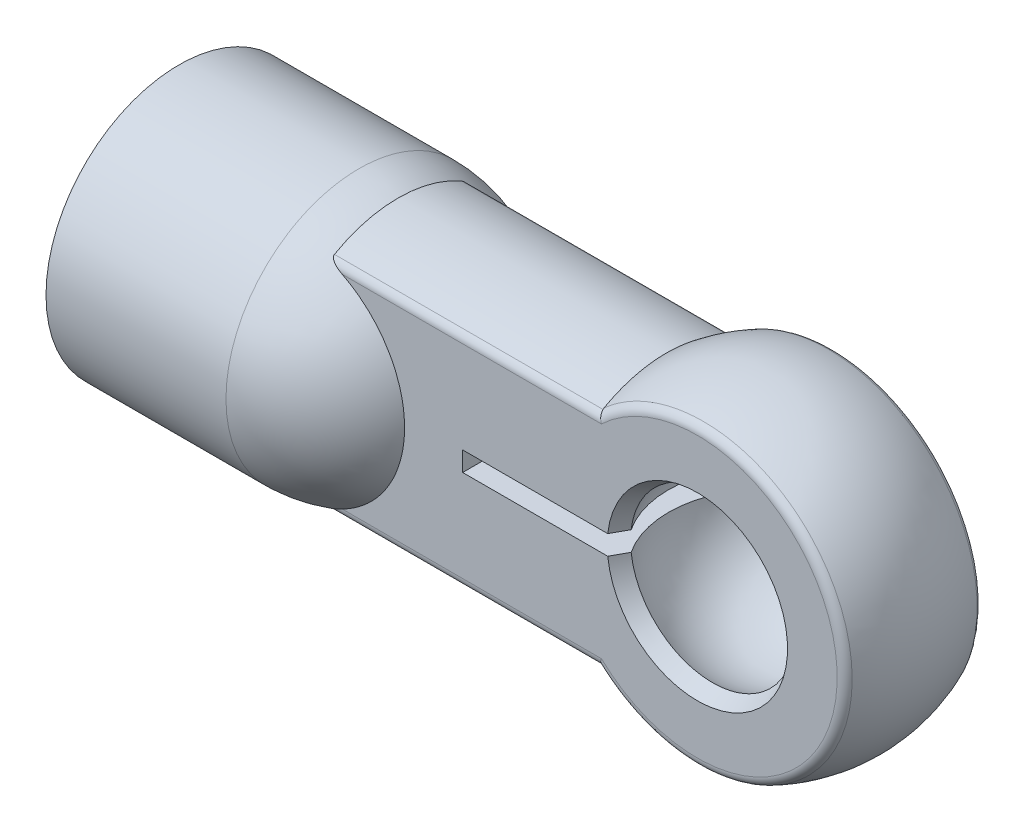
ISO-10303-21;
HEADER;
FILE_DESCRIPTION(('STEP AP214'),'2;1');
FILE_NAME('part.step','',(''),(''),'','','');
FILE_SCHEMA(('AUTOMOTIVE_DESIGN { 1 0 10303 214 1 1 1 1 }'));
ENDSEC;
DATA;
#1=APPLICATION_CONTEXT('core data for automotive mechanical design processes');
#2=APPLICATION_PROTOCOL_DEFINITION('international standard','automotive_design',2000,#1);
#3=PRODUCT_CONTEXT('',#1,'mechanical');
#4=PRODUCT('Part','Part','',(#3));
#5=PRODUCT_RELATED_PRODUCT_CATEGORY('part','',(#4));
#6=PRODUCT_DEFINITION_FORMATION('','',#4);
#7=PRODUCT_DEFINITION_CONTEXT('part definition',#1,'design');
#8=PRODUCT_DEFINITION('design','',#6,#7);
#9=PRODUCT_DEFINITION_SHAPE('','',#8);
#10=(LENGTH_UNIT() NAMED_UNIT(*) SI_UNIT(.MILLI.,.METRE.));
#11=(NAMED_UNIT(*) PLANE_ANGLE_UNIT() SI_UNIT($,.RADIAN.));
#12=(NAMED_UNIT(*) SI_UNIT($,.STERADIAN.) SOLID_ANGLE_UNIT());
#13=UNCERTAINTY_MEASURE_WITH_UNIT(LENGTH_MEASURE(1.E-05),#10,'distance_accuracy_value','');
#14=(GEOMETRIC_REPRESENTATION_CONTEXT(3) GLOBAL_UNCERTAINTY_ASSIGNED_CONTEXT((#13)) GLOBAL_UNIT_ASSIGNED_CONTEXT((#10,
#11,#12)) REPRESENTATION_CONTEXT('',''));
#15=CARTESIAN_POINT('',(0.,0.,0.));
#16=DIRECTION('',(0.,0.,1.));
#17=DIRECTION('',(1.,0.,0.));
#18=AXIS2_PLACEMENT_3D('',#15,#16,#17);
#19=CARTESIAN_POINT('',(0.,0.,0.));
#20=DIRECTION('',(0.,1.,0.));
#21=DIRECTION('',(0.,0.,-1.));
#22=AXIS2_PLACEMENT_3D('',#19,#20,#21);
#23=SPHERICAL_SURFACE('',#22,5.);
#24=CARTESIAN_POINT('',(0.,-5.,0.));
#25=VERTEX_POINT('',#24);
#26=VERTEX_LOOP('',#25);
#27=FACE_BOUND('',#26,.T.);
#28=CARTESIAN_POINT('',(0.,5.,0.));
#29=CARTESIAN_POINT('',(-0.0383164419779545,5.00000010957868,0.));
#30=CARTESIAN_POINT('',(-0.0766330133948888,4.99955957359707,0.));
#31=CARTESIAN_POINT('',(-0.16280613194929,4.99757802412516,0.));
#32=CARTESIAN_POINT('',(-0.210657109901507,4.99578981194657,0.));
#33=CARTESIAN_POINT('',(-0.325408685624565,4.98984988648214,0.));
#34=CARTESIAN_POINT('',(-0.392275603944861,4.98503901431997,0.));
#35=CARTESIAN_POINT('',(-0.544831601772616,4.97097403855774,0.));
#36=CARTESIAN_POINT('',(-0.630441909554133,4.96084333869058,0.));
#37=CARTESIAN_POINT('',(-0.765476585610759,4.94131294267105,0.));
#38=CARTESIAN_POINT('',(-0.815116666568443,4.93336721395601,0.));
#39=CARTESIAN_POINT('',(-0.918850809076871,4.91515448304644,0.));
#40=CARTESIAN_POINT('',(-0.972918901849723,4.90473849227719,0.));
#41=CARTESIAN_POINT('',(-1.08536593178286,4.88114350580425,-1.04179644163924E-13));
#42=CARTESIAN_POINT('',(-1.14371098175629,4.86780302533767,-1.06240168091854E-13));
#43=CARTESIAN_POINT('',(-1.26453121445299,4.83788563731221,-1.10210437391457E-13));
#44=CARTESIAN_POINT('',(-1.32696348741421,4.82113521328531,-1.12094941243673E-13));
#45=CARTESIAN_POINT('',(-1.45573006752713,4.78389677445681,-1.15190614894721E-13));
#46=CARTESIAN_POINT('',(-1.52201093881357,4.76322383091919,-1.16341583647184E-13));
#47=CARTESIAN_POINT('',(-1.65819348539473,4.71761593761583,-1.18014954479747E-13));
#48=CARTESIAN_POINT('',(-1.72802971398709,4.69248540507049,-1.18488545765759E-13));
#49=CARTESIAN_POINT('',(-1.87098127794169,4.63742042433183,-1.18791357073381E-13));
#50=CARTESIAN_POINT('',(-1.94401758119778,4.60728067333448,-1.1857704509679E-13));
#51=CARTESIAN_POINT('',(-2.09296087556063,4.54164428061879,-1.18044259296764E-13));
#52=CARTESIAN_POINT('',(-2.16877367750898,4.50593371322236,-1.17720261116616E-13));
#53=CARTESIAN_POINT('',(-2.32278592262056,4.428601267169,-1.16674026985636E-13));
#54=CARTESIAN_POINT('',(-2.40087429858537,4.38675823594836,-1.15930098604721E-13));
#55=CARTESIAN_POINT('',(-2.55888063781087,4.29660826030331,-1.13176583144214E-13));
#56=CARTESIAN_POINT('',(-2.63866944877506,4.24807420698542,-1.11100775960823E-13));
#57=CARTESIAN_POINT('',(-2.75771894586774,4.17101148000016,-1.08462053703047E-13));
#58=CARTESIAN_POINT('',(-2.79802375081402,4.14408165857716,-1.07651563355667E-13));
#59=CARTESIAN_POINT('',(-2.87881983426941,4.08838141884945,-1.05661356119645E-13));
#60=CARTESIAN_POINT('',(-2.91929115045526,4.05958197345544,-1.04473017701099E-13));
#61=CARTESIAN_POINT('',(-3.00032195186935,4.00008192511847,-1.02192272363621E-13));
#62=CARTESIAN_POINT('',(-3.04086006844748,3.96935223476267,-1.01102866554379E-13));
#63=CARTESIAN_POINT('',(-3.12192239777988,3.90593275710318,0.));
#64=CARTESIAN_POINT('',(-3.16242384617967,3.87321386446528,0.));
#65=CARTESIAN_POINT('',(-3.24330416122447,3.80576068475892,0.));
#66=CARTESIAN_POINT('',(-3.28365881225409,3.77099735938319,0.));
#67=CARTESIAN_POINT('',(-3.3641309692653,3.69940373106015,0.));
#68=CARTESIAN_POINT('',(-3.40422277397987,3.66254453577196,0.));
#69=CARTESIAN_POINT('',(-3.48404855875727,3.58671194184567,0.));
#70=CARTESIAN_POINT('',(-3.52375531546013,3.54770988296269,0.));
#71=CARTESIAN_POINT('',(-3.60268428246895,3.46754920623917,0.));
#72=CARTESIAN_POINT('',(-3.64187771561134,3.42636224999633,0.));
#73=CARTESIAN_POINT('',(-3.71964730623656,3.34179486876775,0.));
#74=CARTESIAN_POINT('',(-3.7581931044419,3.2983865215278,0.));
#75=CARTESIAN_POINT('',(-3.83452878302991,3.20934547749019,0.));
#76=CARTESIAN_POINT('',(-3.87228669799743,3.16368537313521,0.));
#77=CARTESIAN_POINT('',(-3.94690218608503,3.07011656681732,0.));
#78=CARTESIAN_POINT('',(-3.9837261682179,3.02218107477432,0.));
#79=CARTESIAN_POINT('',(-4.05632376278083,2.9240444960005,0.));
#80=CARTESIAN_POINT('',(-4.09206214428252,2.87381734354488,0.));
#81=CARTESIAN_POINT('',(-4.16233313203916,2.77108832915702,0.));
#82=CARTESIAN_POINT('',(-4.19682885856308,2.7185612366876,0.));
#83=CARTESIAN_POINT('',(-4.26445403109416,2.61123175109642,0.));
#84=CARTESIAN_POINT('',(-4.29754494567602,2.55640507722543,0.));
#85=CARTESIAN_POINT('',(-4.36219522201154,2.44448500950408,0.));
#86=CARTESIAN_POINT('',(-4.39371440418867,2.3873684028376,0.));
#87=CARTESIAN_POINT('',(-4.45505156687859,2.27088687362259,0.));
#88=CARTESIAN_POINT('',(-4.48482773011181,2.21149992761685,0.));
#89=CARTESIAN_POINT('',(-4.54250528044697,2.09050659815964,0.));
#90=CARTESIAN_POINT('',(-4.57036323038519,2.02887950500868,0.));
#91=CARTESIAN_POINT('',(-4.62402736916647,1.90344588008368,0.));
#92=CARTESIAN_POINT('',(-4.64978852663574,1.83962007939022,0.));
#93=CARTESIAN_POINT('',(-4.69907926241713,1.70984079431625,0.));
#94=CARTESIAN_POINT('',(-4.72256224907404,1.64386961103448,0.));
#95=CARTESIAN_POINT('',(-4.767114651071,1.50986369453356,0.));
#96=CARTESIAN_POINT('',(-4.78813595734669,1.44181296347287,0.));
#97=CARTESIAN_POINT('',(-4.82758150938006,1.30372505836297,0.));
#98=CARTESIAN_POINT('',(-4.8459561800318,1.23367371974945,0.));
#99=CARTESIAN_POINT('',(-4.87992442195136,1.09167527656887,0.));
#100=CARTESIAN_POINT('',(-4.89546701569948,1.0197159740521,0.));
#101=CARTESIAN_POINT('',(-4.9235867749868,0.874006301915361,0.));
#102=CARTESIAN_POINT('',(-4.93611162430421,0.800245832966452,0.));
#103=CARTESIAN_POINT('',(-4.95801451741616,0.651053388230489,0.));
#104=CARTESIAN_POINT('',(-4.96733901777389,0.575613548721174,0.));
#105=CARTESIAN_POINT('',(-4.9749371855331,0.50000000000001,0.));
#106=B_SPLINE_CURVE_WITH_KNOTS('',3,(#28,#29,#30,#31,#32,#33,#34,#35,#36,#37,#38,#39,#40,#41,
#42,#43,#44,#45,#46,#47,#48,#49,#50,#51,#52,#53,#54,#55,#56,#57,#58,#59,#60,#61,#62,#63,#64,#65,
#66,#67,#68,#69,#70,#71,#72,#73,#74,#75,#76,#77,#78,#79,#80,#81,#82,#83,#84,#85,#86,#87,#88,#89,
#90,#91,#92,#93,#94,#95,#96,#97,#98,#99,#100,#101,#102,#103,#104,#105),.UNSPECIFIED.,.F.,.F.,(4,
2,2,2,2,2,2,2,2,2,2,2,2,2,2,2,2,2,2,2,2,2,2,2,2,2,2,2,2,2,2,2,2,2,2,2,2,2,4),(0.,
0.114947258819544,0.258580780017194,0.459648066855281,0.718142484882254,0.868939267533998,
1.0340948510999,1.21360889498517,1.40748102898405,1.61571085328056,1.83829793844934,
2.07524182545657,2.32654202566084,2.59219802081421,2.87220926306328,3.01761328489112,
3.16660706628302,3.31919058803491,3.47536383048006,3.63512677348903,3.79847939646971,
3.96542167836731,4.13595359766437,4.31007513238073,4.48778626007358,4.66908695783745,
4.85397720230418,5.04245696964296,5.23452623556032,5.43018497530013,5.62943316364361,
5.83227077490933,6.03869778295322,6.24871416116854,6.46231988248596,6.67951491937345,
6.9002992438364,7.12467282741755,7.352635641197),.UNSPECIFIED.);
#107=CARTESIAN_POINT('',(0.,5.,0.));
#108=VERTEX_POINT('',#107);
#109=CARTESIAN_POINT('',(-4.97493718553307,0.500000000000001,-4.25585492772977E-13));
#110=VERTEX_POINT('',#109);
#111=EDGE_CURVE('E677',#108,#110,#106,.T.);
#112=ORIENTED_EDGE('',*,*,#111,.F.);
#113=ORIENTED_EDGE('',*,*,#111,.T.);
#114=CARTESIAN_POINT('',(0.,0.5,0.));
#115=DIRECTION('',(0.,1.,0.));
#116=DIRECTION('',(0.,0.,1.));
#117=AXIS2_PLACEMENT_3D('',#114,#115,#116);
#118=CIRCLE('',#117,4.9749371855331);
#119=CARTESIAN_POINT('',(-4.16073476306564,0.499999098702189,-2.72732233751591));
#120=VERTEX_POINT('',#119);
#121=EDGE_CURVE('E256',#110,#120,#118,.F.);
#122=ORIENTED_EDGE('',*,*,#121,.T.);
#123=CARTESIAN_POINT('',(-4.16073487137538,0.499998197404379,-2.72732233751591));
#124=CARTESIAN_POINT('',(-4.14634936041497,0.619824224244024,-2.72732233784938));
#125=CARTESIAN_POINT('',(-4.12676075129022,0.739023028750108,-2.72732233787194));
#126=CARTESIAN_POINT('',(-4.0773843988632,0.975285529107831,-2.72732233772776));
#127=CARTESIAN_POINT('',(-4.04759698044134,1.09234929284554,-2.72732233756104));
#128=CARTESIAN_POINT('',(-3.97806073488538,1.32336379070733,-2.72732233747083));
#129=CARTESIAN_POINT('',(-3.93832098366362,1.43731725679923,-2.72732233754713));
#130=CARTESIAN_POINT('',(-3.84916785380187,1.66137102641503,-2.72732233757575));
#131=CARTESIAN_POINT('',(-3.79975482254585,1.77147146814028,-2.72732233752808));
#132=CARTESIAN_POINT('',(-3.69285692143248,1.98454081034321,-2.72732233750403));
#133=CARTESIAN_POINT('',(-3.63558201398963,2.08761512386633,-2.72732233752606));
#134=CARTESIAN_POINT('',(-3.51253035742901,2.28860939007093,-2.72732233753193));
#135=CARTESIAN_POINT('',(-3.4467505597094,2.38652747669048,-2.72732233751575));
#136=CARTESIAN_POINT('',(-3.30721994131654,2.57640854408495,-2.72732233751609));
#137=CARTESIAN_POINT('',(-3.23347445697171,2.66837544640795,-2.72732233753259));
#138=CARTESIAN_POINT('',(-3.07847355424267,2.84580298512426,-2.72732233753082));
#139=CARTESIAN_POINT('',(-2.99721553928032,2.9312613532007,-2.72732233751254));
#140=CARTESIAN_POINT('',(-2.82781264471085,3.09500599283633,-2.72732233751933));
#141=CARTESIAN_POINT('',(-2.73966968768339,3.17329425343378,-2.72732233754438));
#142=CARTESIAN_POINT('',(-2.55710346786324,3.32216921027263,-2.72732233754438));
#143=CARTESIAN_POINT('',(-2.46268020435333,3.39275590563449,-2.72732233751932));
#144=CARTESIAN_POINT('',(-2.26815651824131,3.52577250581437,-2.72732233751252));
#145=CARTESIAN_POINT('',(-2.1680521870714,3.58819669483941,-2.7273223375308));
#146=CARTESIAN_POINT('',(-1.96297431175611,3.70436606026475,-2.72732233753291));
#147=CARTESIAN_POINT('',(-1.8580024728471,3.75811424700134,-2.72732233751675));
#148=CARTESIAN_POINT('',(-1.64380065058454,3.85662319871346,-2.72732233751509));
#149=CARTESIAN_POINT('',(-1.53456665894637,3.90137524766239,-2.72732233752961));
#150=CARTESIAN_POINT('',(-1.3127546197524,3.98149307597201,-2.72732233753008));
#151=CARTESIAN_POINT('',(-1.2001778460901,4.01686238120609,-2.72732233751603));
#152=CARTESIAN_POINT('',(-0.972592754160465,4.07794579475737,-2.72732233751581));
#153=CARTESIAN_POINT('',(-0.857587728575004,4.10367218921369,-2.72732233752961));
#154=CARTESIAN_POINT('',(-0.625866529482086,4.14534077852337,-2.72732233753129));
#155=CARTESIAN_POINT('',(-0.509151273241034,4.16128803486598,-2.7273223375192));
#156=CARTESIAN_POINT('',(-0.326800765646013,4.17842141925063,-2.7273223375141));
#157=CARTESIAN_POINT('',(-0.261468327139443,4.1830174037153,-2.72732233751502));
#158=CARTESIAN_POINT('',(-0.130759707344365,4.18913934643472,-2.72732233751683));
#159=CARTESIAN_POINT('',(-0.0653837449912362,4.19066997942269,-2.72732233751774));
#160=CARTESIAN_POINT('',(0.,4.19066973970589,-2.72732233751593));
#161=B_SPLINE_CURVE_WITH_KNOTS('',3,(#123,#124,#125,#126,#127,#128,#129,#130,#131,#132,#133,
#134,#135,#136,#137,#138,#139,#140,#141,#142,#143,#144,#145,#146,#147,#148,#149,#150,#151,#152,
#153,#154,#155,#156,#157,#158,#159,#160),.UNSPECIFIED.,.F.,.F.,(4,2,2,2,2,2,2,2,2,2,2,2,2,2,2,2,
2,2,4),(0.,0.361943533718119,0.72387553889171,1.08547867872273,1.44706883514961,
1.80040641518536,2.1538710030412,2.50710025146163,2.86045204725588,3.21370552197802,
3.56695903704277,3.92045860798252,4.27383525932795,4.62755265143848,4.9811369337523,
5.33426916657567,5.68721847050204,5.88363604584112,6.07975385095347),.UNSPECIFIED.);
#162=CARTESIAN_POINT('',(0.,4.19066973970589,-2.72732233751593));
#163=VERTEX_POINT('',#162);
#164=EDGE_CURVE('E663',#120,#163,#161,.T.);
#165=ORIENTED_EDGE('',*,*,#164,.T.);
#166=CARTESIAN_POINT('',(0.,0.,-2.72732233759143));
#167=DIRECTION('',(0.,0.,-1.));
#168=DIRECTION('',(-1.,0.,0.));
#169=AXIS2_PLACEMENT_3D('',#166,#167,#168);
#170=CIRCLE('',#169,4.19066973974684);
#171=CARTESIAN_POINT('',(0.,-4.19066973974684,-2.72732233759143));
#172=VERTEX_POINT('',#171);
#173=EDGE_CURVE('E667',#163,#172,#170,.T.);
#174=ORIENTED_EDGE('',*,*,#173,.T.);
#175=CARTESIAN_POINT('',(0.,-4.19066973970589,-2.72732233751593));
#176=CARTESIAN_POINT('',(-0.120686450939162,-4.1906836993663,-2.72732233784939));
#177=CARTESIAN_POINT('',(-0.241370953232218,-4.18545689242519,-2.72732233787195));
#178=CARTESIAN_POINT('',(-0.481836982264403,-4.16462225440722,-2.72732233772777));
#179=CARTESIAN_POINT('',(-0.60161853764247,-4.14901475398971,-2.72732233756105));
#180=CARTESIAN_POINT('',(-0.839279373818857,-4.10753807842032,-2.72732233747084));
#181=CARTESIAN_POINT('',(-0.957160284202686,-4.08167824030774,-2.72732233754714));
#182=CARTESIAN_POINT('',(-1.19025064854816,-4.01989430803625,-2.72732233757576));
#183=CARTESIAN_POINT('',(-1.3054601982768,-3.983970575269,-2.72732233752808));
#184=CARTESIAN_POINT('',(-1.52976176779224,-3.90325804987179,-2.72732233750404));
#185=CARTESIAN_POINT('',(-1.63893339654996,-3.85869029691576,-2.72732233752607));
#186=CARTESIAN_POINT('',(-1.85317348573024,-3.76049870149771,-2.72732233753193));
#187=CARTESIAN_POINT('',(-1.95824045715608,-3.70687160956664,-2.72732233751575));
#188=CARTESIAN_POINT('',(-2.16341287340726,-3.59099282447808,-2.72732233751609));
#189=CARTESIAN_POINT('',(-2.26352157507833,-3.52874689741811,-2.72732233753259));
#190=CARTESIAN_POINT('',(-2.45817521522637,-3.39602247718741,-2.72732233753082));
#191=CARTESIAN_POINT('',(-2.55271821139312,-3.32554113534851,-2.72732233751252));
#192=CARTESIAN_POINT('',(-2.73550502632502,-3.17688506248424,-2.72732233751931));
#193=CARTESIAN_POINT('',(-2.82375059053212,-3.09871247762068,-2.72732233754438));
#194=CARTESIAN_POINT('',(-2.99334448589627,-2.93521297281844,-2.72732233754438));
#195=CARTESIAN_POINT('',(-3.07469281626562,-2.84988605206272,-2.72732233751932));
#196=CARTESIAN_POINT('',(-3.22996830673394,-2.67262239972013,-2.72732233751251));
#197=CARTESIAN_POINT('',(-3.30389025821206,-2.58068110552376,-2.7273223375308));
#198=CARTESIAN_POINT('',(-3.44369810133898,-2.39092857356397,-2.72732233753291));
#199=CARTESIAN_POINT('',(-3.509586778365,-2.29311938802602,-2.72732233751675));
#200=CARTESIAN_POINT('',(-3.63294895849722,-2.09220097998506,-2.72732233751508));
#201=CARTESIAN_POINT('',(-3.69041428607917,-1.98908673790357,-2.7273223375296));
#202=CARTESIAN_POINT('',(-3.79642470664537,-1.77841818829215,-2.72732233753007));
#203=CARTESIAN_POINT('',(-3.84497314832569,-1.67086556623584,-2.72732233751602));
#204=CARTESIAN_POINT('',(-3.93277391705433,-1.45219416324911,-2.72732233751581));
#205=CARTESIAN_POINT('',(-3.97203804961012,-1.34108011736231,-2.7273223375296));
#206=CARTESIAN_POINT('',(-4.04105616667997,-1.11598572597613,-2.72732233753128));
#207=CARTESIAN_POINT('',(-4.07081506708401,-1.00200689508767,-2.72732233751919));
#208=CARTESIAN_POINT('',(-4.1095827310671,-0.823003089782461,-2.72732233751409));
#209=CARTESIAN_POINT('',(-4.12194086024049,-0.758685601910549,-2.727322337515));
#210=CARTESIAN_POINT('',(-4.14361423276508,-0.629640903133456,-2.72732233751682));
#211=CARTESIAN_POINT('',(-4.15293409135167,-0.564914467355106,-2.72732233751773));
#212=CARTESIAN_POINT('',(-4.16073493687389,-0.499997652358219,-2.72732233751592));
#213=B_SPLINE_CURVE_WITH_KNOTS('',3,(#175,#176,#177,#178,#179,#180,#181,#182,#183,#184,#185,
#186,#187,#188,#189,#190,#191,#192,#193,#194,#195,#196,#197,#198,#199,#200,#201,#202,#203,#204,
#205,#206,#207,#208,#209,#210,#211,#212),.UNSPECIFIED.,.F.,.F.,(4,2,2,2,2,2,2,2,2,2,2,2,2,2,2,2,
2,2,4),(0.,0.361943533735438,0.72387553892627,1.08547867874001,1.44706883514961,
1.80040641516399,2.15387100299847,2.5071002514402,2.86045204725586,3.21370552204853,
3.56695903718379,3.92045860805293,4.27383525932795,4.62755265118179,4.98113693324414,
5.33426916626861,5.68721847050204,5.88363632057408,6.07975439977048),.UNSPECIFIED.);
#214=CARTESIAN_POINT('',(-4.1607347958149,-0.49999882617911,-2.72732233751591));
#215=VERTEX_POINT('',#214);
#216=EDGE_CURVE('E367',#172,#215,#213,.T.);
#217=ORIENTED_EDGE('',*,*,#216,.T.);
#218=CARTESIAN_POINT('',(0.,-0.499999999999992,0.));
#219=DIRECTION('',(0.,1.,0.));
#220=DIRECTION('',(0.,0.,1.));
#221=AXIS2_PLACEMENT_3D('',#218,#219,#220);
#222=CIRCLE('',#221,4.9749371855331);
#223=CARTESIAN_POINT('',(-4.16073472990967,-0.499999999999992,2.72732222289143));
#224=VERTEX_POINT('',#223);
#225=EDGE_CURVE('E381',#215,#224,#222,.T.);
#226=ORIENTED_EDGE('',*,*,#225,.T.);
#227=CARTESIAN_POINT('',(0.,0.,2.72732233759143));
#228=DIRECTION('',(0.,0.,1.));
#229=DIRECTION('',(1.,0.,0.));
#230=AXIS2_PLACEMENT_3D('',#227,#228,#229);
#231=CIRCLE('',#230,4.19066973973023);
#232=CARTESIAN_POINT('',(-4.16073372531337,0.5,2.72732063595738));
#233=VERTEX_POINT('',#232);
#234=EDGE_CURVE('E393',#224,#233,#231,.T.);
#235=ORIENTED_EDGE('',*,*,#234,.T.);
#236=CARTESIAN_POINT('',(0.,0.499999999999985,0.));
#237=DIRECTION('',(0.,1.,0.));
#238=DIRECTION('',(0.,0.,1.));
#239=AXIS2_PLACEMENT_3D('',#236,#237,#238);
#240=CIRCLE('',#239,4.9749371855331);
#241=EDGE_CURVE('E659',#233,#110,#240,.F.);
#242=ORIENTED_EDGE('',*,*,#241,.T.);
#243=EDGE_LOOP('',(#112,#113,#122,#165,#174,#217,#226,#235,#242));
#244=FACE_BOUND('',#243,.T.);
#245=ADVANCED_FACE('F16',(#27,#244),#23,.F.);
#246=CARTESIAN_POINT('',(-12.,0.5,-9.9));
#247=DIRECTION('',(-1.,0.,0.));
#248=DIRECTION('',(0.,0.,1.));
#249=AXIS2_PLACEMENT_3D('',#246,#247,#248);
#250=PLANE('',#249);
#251=DIRECTION('',(0.,1.,0.));
#252=VECTOR('',#251,1.);
#253=CARTESIAN_POINT('',(-12.,0.5,3.5));
#254=LINE('',#253,#252);
#255=CARTESIAN_POINT('',(-12.,-0.499999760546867,3.5));
#256=VERTEX_POINT('',#255);
#257=CARTESIAN_POINT('',(-12.,0.499999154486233,3.5));
#258=VERTEX_POINT('',#257);
#259=EDGE_CURVE('E494',#256,#258,#254,.T.);
#260=ORIENTED_EDGE('',*,*,#259,.F.);
#261=DIRECTION('',(0.,0.,-1.));
#262=VECTOR('',#261,1.);
#263=CARTESIAN_POINT('',(-12.,-0.5,-9.9));
#264=LINE('',#263,#262);
#265=CARTESIAN_POINT('',(-12.,-0.499999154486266,-3.5));
#266=VERTEX_POINT('',#265);
#267=EDGE_CURVE('E245',#256,#266,#264,.T.);
#268=ORIENTED_EDGE('',*,*,#267,.T.);
#269=DIRECTION('',(0.,1.,0.));
#270=VECTOR('',#269,1.);
#271=CARTESIAN_POINT('',(-12.,0.5,-3.5));
#272=LINE('',#271,#270);
#273=CARTESIAN_POINT('',(-12.,0.499999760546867,-3.5));
#274=VERTEX_POINT('',#273);
#275=EDGE_CURVE('E674',#274,#266,#272,.F.);
#276=ORIENTED_EDGE('',*,*,#275,.F.);
#277=DIRECTION('',(0.,0.,1.));
#278=VECTOR('',#277,1.);
#279=CARTESIAN_POINT('',(-12.,0.5,-9.9));
#280=LINE('',#279,#278);
#281=EDGE_CURVE('E252',#274,#258,#280,.T.);
#282=ORIENTED_EDGE('',*,*,#281,.T.);
#283=EDGE_LOOP('',(#260,#268,#276,#282));
#284=FACE_BOUND('',#283,.T.);
#285=ADVANCED_FACE('F566',(#284),#250,.F.);
#286=CARTESIAN_POINT('',(0.,0.,3.));
#287=DIRECTION('',(0.,0.,-1.));
#288=DIRECTION('',(0.998982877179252,-0.0450911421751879,0.));
#289=AXIS2_PLACEMENT_3D('',#286,#287,#288);
#290=TOROIDAL_SURFACE('',#289,7.145802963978,0.5);
#291=CARTESIAN_POINT('',(0.,0.,3.19354838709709));
#292=DIRECTION('',(0.,0.,-1.));
#293=DIRECTION('',(0.998982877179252,-0.0450911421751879,0.));
#294=AXIS2_PLACEMENT_3D('',#291,#292,#293);
#295=CIRCLE('',#294,7.60682251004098);
#296=CARTESIAN_POINT('',(-5.080600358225,5.66138222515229,3.193548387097));
#297=VERTEX_POINT('',#296);
#298=CARTESIAN_POINT('',(-5.080600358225,-5.66138222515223,3.1935483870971));
#299=VERTEX_POINT('',#298);
#300=EDGE_CURVE('E634',#297,#299,#295,.T.);
#301=ORIENTED_EDGE('',*,*,#300,.F.);
#302=CARTESIAN_POINT('',(-5.074539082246,5.62916512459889,3.24999999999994));
#303=CARTESIAN_POINT('',(-5.07504494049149,5.63048183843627,3.24771938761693));
#304=CARTESIAN_POINT('',(-5.07551838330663,5.63180026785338,3.24543259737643));
#305=CARTESIAN_POINT('',(-5.07640235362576,5.63444413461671,3.24084037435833));
#306=CARTESIAN_POINT('',(-5.07681266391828,5.63576958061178,3.23853490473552));
#307=CARTESIAN_POINT('',(-5.07757037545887,5.6384274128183,3.23390529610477));
#308=CARTESIAN_POINT('',(-5.077917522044,5.63975980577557,3.23158111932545));
#309=CARTESIAN_POINT('',(-5.07854895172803,5.6424314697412,3.22691406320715));
#310=CARTESIAN_POINT('',(-5.07883294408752,5.64377074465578,3.22457114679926));
#311=CARTESIAN_POINT('',(-5.07933809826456,5.64645610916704,3.21986657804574));
#312=CARTESIAN_POINT('',(-5.07955893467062,5.64780219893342,3.21750489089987));
#313=CARTESIAN_POINT('',(-5.07993781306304,5.65050113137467,3.21276274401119));
#314=CARTESIAN_POINT('',(-5.08009549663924,5.65185396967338,3.21038225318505));
#315=CARTESIAN_POINT('',(-5.0803480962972,5.65456633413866,3.20560246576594));
#316=CARTESIAN_POINT('',(-5.08044262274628,5.6559258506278,3.20320314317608));
#317=CARTESIAN_POINT('',(-5.08056895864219,5.65865151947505,3.19838563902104));
#318=CARTESIAN_POINT('',(-5.08060034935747,5.66001765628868,3.19596743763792));
#319=CARTESIAN_POINT('',(-5.080600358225,5.66138222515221,3.19354838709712));
#320=B_SPLINE_CURVE_WITH_KNOTS('',3,(#302,#303,#304,#305,#306,#307,#308,#309,#310,#311,#312,
#313,#314,#315,#316,#317,#318,#319),.UNSPECIFIED.,.F.,.F.,(4,2,2,2,2,2,2,2,4),(0.,
0.00804448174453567,0.0161160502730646,0.0242194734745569,0.0323594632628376,0.0405406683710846,
0.0487676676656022,0.057044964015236,0.0653769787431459),.UNSPECIFIED.);
#321=CARTESIAN_POINT('',(-5.07453908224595,5.62916512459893,3.24999999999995));
#322=VERTEX_POINT('',#321);
#323=EDGE_CURVE('E492',#297,#322,#320,.F.);
#324=ORIENTED_EDGE('',*,*,#323,.T.);
#325=CARTESIAN_POINT('',(-5.07453908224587,5.62916512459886,3.24999999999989));
#326=CARTESIAN_POINT('',(-5.07356515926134,5.62662992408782,3.25439102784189));
#327=CARTESIAN_POINT('',(-5.07256691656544,5.62402978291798,3.25873912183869));
#328=CARTESIAN_POINT('',(-5.07051209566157,5.61867611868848,3.26738989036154));
#329=CARTESIAN_POINT('',(-5.06945502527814,5.61592129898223,3.27169164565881));
#330=CARTESIAN_POINT('',(-5.06728175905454,5.61025800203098,3.28024366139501));
#331=CARTESIAN_POINT('',(-5.06616506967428,5.60734824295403,3.2844929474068));
#332=CARTESIAN_POINT('',(-5.06387193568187,5.60137497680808,3.29293386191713));
#333=CARTESIAN_POINT('',(-5.06269499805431,5.59831020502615,3.29712446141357));
#334=CARTESIAN_POINT('',(-5.06028086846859,5.59202700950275,3.30544170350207));
#335=CARTESIAN_POINT('',(-5.05904318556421,5.58880734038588,3.30956726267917));
#336=CARTESIAN_POINT('',(-5.05650721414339,5.58221464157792,3.31774801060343));
#337=CARTESIAN_POINT('',(-5.0552084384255,5.57884038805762,3.3218020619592));
#338=CARTESIAN_POINT('',(-5.0525500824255,5.57193901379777,3.32983327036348));
#339=CARTESIAN_POINT('',(-5.05119002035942,5.56841069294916,3.33380923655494));
#340=CARTESIAN_POINT('',(-5.04840905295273,5.56120188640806,3.34167765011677));
#341=CARTESIAN_POINT('',(-5.0469876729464,5.55752022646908,3.34556885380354));
#342=CARTESIAN_POINT('',(-5.04408419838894,5.55000565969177,3.353261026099));
#343=CARTESIAN_POINT('',(-5.04260163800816,5.54617160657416,3.35706069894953));
#344=CARTESIAN_POINT('',(-5.03957610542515,5.53835339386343,3.36456301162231));
#345=CARTESIAN_POINT('',(-5.03803267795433,5.53436811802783,3.36826430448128));
#346=CARTESIAN_POINT('',(-5.03488589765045,5.52624882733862,3.37556298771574));
#347=CARTESIAN_POINT('',(-5.0332821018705,5.52211372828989,3.37915898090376));
#348=CARTESIAN_POINT('',(-5.03001525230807,5.51369639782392,3.38624013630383));
#349=CARTESIAN_POINT('',(-5.02835176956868,5.50941311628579,3.38972385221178));
#350=CARTESIAN_POINT('',(-5.02496643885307,5.50070124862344,3.39657347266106));
#351=CARTESIAN_POINT('',(-5.02324417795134,5.49627164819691,3.39993788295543));
#352=CARTESIAN_POINT('',(-5.01974227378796,5.48726928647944,3.40654189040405));
#353=CARTESIAN_POINT('',(-5.01796223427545,5.48269554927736,3.40977994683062));
#354=CARTESIAN_POINT('',(-5.01434639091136,5.47340703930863,3.41612416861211));
#355=CARTESIAN_POINT('',(-5.01251021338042,5.46869132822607,3.41922874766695));
#356=CARTESIAN_POINT('',(-5.00878231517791,5.45912226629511,3.42529913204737));
#357=CARTESIAN_POINT('',(-5.00689022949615,5.45426802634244,3.42826330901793));
#358=CARTESIAN_POINT('',(-5.00196051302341,5.44160498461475,3.43569927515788));
#359=CARTESIAN_POINT('',(-4.99889969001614,5.43372755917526,3.4400396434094));
#360=CARTESIAN_POINT('',(-4.99248718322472,5.4172152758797,3.44856494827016));
#361=CARTESIAN_POINT('',(-4.98913012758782,5.40856597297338,3.45271779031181));
#362=CARTESIAN_POINT('',(-4.98210656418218,5.39050047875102,3.46076542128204));
#363=CARTESIAN_POINT('',(-4.97843416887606,5.38107110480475,3.46462562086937));
#364=CARTESIAN_POINT('',(-4.97277232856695,5.36657060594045,3.47005544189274));
#365=CARTESIAN_POINT('',(-4.97081561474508,5.36156585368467,3.4718394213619));
#366=CARTESIAN_POINT('',(-4.96682104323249,5.3513632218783,3.47529520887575));
#367=CARTESIAN_POINT('',(-4.96478248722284,5.34616397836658,3.47696220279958));
#368=CARTESIAN_POINT('',(-4.9606241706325,5.33557383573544,3.48016841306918));
#369=CARTESIAN_POINT('',(-4.95850374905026,5.33018169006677,3.48170264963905));
#370=CARTESIAN_POINT('',(-4.95418209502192,5.31920759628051,3.48462738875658));
#371=CARTESIAN_POINT('',(-4.95198024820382,5.31362451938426,3.48601275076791));
#372=CARTESIAN_POINT('',(-4.9474967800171,5.3022712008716,3.48862331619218));
#373=CARTESIAN_POINT('',(-4.94521460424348,5.29649995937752,3.4898432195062));
#374=CARTESIAN_POINT('',(-4.94057217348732,5.28477368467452,3.49210606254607));
#375=CARTESIAN_POINT('',(-4.93821143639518,5.27881778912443,3.49314354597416));
#376=CARTESIAN_POINT('',(-4.93341430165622,5.2667263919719,3.4950244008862));
#377=CARTESIAN_POINT('',(-4.93097750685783,5.26059017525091,3.49586216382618));
#378=CARTESIAN_POINT('',(-4.9260314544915,5.24814317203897,3.49732615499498));
#379=CARTESIAN_POINT('',(-4.92352189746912,5.24183182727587,3.49794662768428));
#380=CARTESIAN_POINT('',(-4.91843433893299,5.22904051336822,3.49895837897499));
#381=CARTESIAN_POINT('',(-4.9158561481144,5.22256015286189,3.49934376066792));
#382=CARTESIAN_POINT('',(-4.91063627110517,5.20943766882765,3.4998676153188));
#383=CARTESIAN_POINT('',(-4.90799451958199,5.20279533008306,3.50000005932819));
#384=CARTESIAN_POINT('',(-4.905354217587,5.196152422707,3.5));
#385=B_SPLINE_CURVE_WITH_KNOTS('',3,(#325,#326,#327,#328,#329,#330,#331,#332,#333,#334,#335,
#336,#337,#338,#339,#340,#341,#342,#343,#344,#345,#346,#347,#348,#349,#350,#351,#352,#353,#354,
#355,#356,#357,#358,#359,#360,#361,#362,#363,#364,#365,#366,#367,#368,#369,#370,#371,#372,#373,
#374,#375,#376,#377,#378,#379,#380,#381,#382,#383,#384),.UNSPECIFIED.,.F.,.F.,(4,2,2,2,2,2,2,2,
2,2,2,2,2,2,2,2,2,2,2,2,2,2,2,2,2,2,2,2,2,4),(0.,0.0154883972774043,0.0311351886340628,
0.0469417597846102,0.0629094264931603,0.0790394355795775,0.095332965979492,0.111791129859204,
0.128414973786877,0.145205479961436,0.162163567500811,0.179290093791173,0.196585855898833,
0.21405159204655,0.231687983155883,0.249495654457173,0.267475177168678,0.295963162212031,
0.326443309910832,0.358914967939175,0.375899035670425,0.393380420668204,0.41135877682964,
0.429833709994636,0.448804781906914,0.468271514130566,0.488233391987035,0.508689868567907,
0.529640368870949,0.551084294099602),.UNSPECIFIED.);
#386=CARTESIAN_POINT('',(-4.905354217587,5.196152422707,3.5));
#387=VERTEX_POINT('',#386);
#388=EDGE_CURVE('E182',#387,#322,#385,.F.);
#389=ORIENTED_EDGE('',*,*,#388,.F.);
#390=CARTESIAN_POINT('',(0.,0.,3.5));
#391=DIRECTION('',(0.,0.,-1.));
#392=DIRECTION('',(-0.686466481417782,0.727161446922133,0.));
#393=AXIS2_PLACEMENT_3D('',#390,#391,#392);
#394=CIRCLE('',#393,7.14580296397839);
#395=CARTESIAN_POINT('',(7.13853480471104,-0.322212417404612,3.5));
#396=VERTEX_POINT('',#395);
#397=EDGE_CURVE('E423',#387,#396,#394,.T.);
#398=ORIENTED_EDGE('',*,*,#397,.T.);
#399=CARTESIAN_POINT('',(0.,0.,3.5));
#400=DIRECTION('',(0.,0.,-1.));
#401=DIRECTION('',(0.998982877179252,-0.0450911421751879,0.));
#402=AXIS2_PLACEMENT_3D('',#399,#400,#401);
#403=CIRCLE('',#402,7.14580296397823);
#404=CARTESIAN_POINT('',(-4.90535421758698,-5.19615242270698,3.5));
#405=VERTEX_POINT('',#404);
#406=EDGE_CURVE('E417',#396,#405,#403,.T.);
#407=ORIENTED_EDGE('',*,*,#406,.T.);
#408=CARTESIAN_POINT('',(-4.905354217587,-5.196152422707,3.5));
#409=CARTESIAN_POINT('',(-4.90799419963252,-5.20279452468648,3.50000005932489));
#410=CARTESIAN_POINT('',(-4.91063564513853,-5.20943605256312,3.49986764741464));
#411=CARTESIAN_POINT('',(-4.91585511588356,-5.22255735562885,3.49934390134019));
#412=CARTESIAN_POINT('',(-4.91843320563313,-5.22903734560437,3.4989585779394));
#413=CARTESIAN_POINT('',(-4.92352076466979,-5.24182835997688,3.49794693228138));
#414=CARTESIAN_POINT('',(-4.92603042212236,-5.24813977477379,3.49732648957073));
#415=CARTESIAN_POINT('',(-4.93097687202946,-5.26058735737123,3.49586249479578));
#416=CARTESIAN_POINT('',(-4.9334139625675,-5.26672408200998,3.49502468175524));
#417=CARTESIAN_POINT('',(-4.93821187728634,-5.27881692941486,3.49314361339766));
#418=CARTESIAN_POINT('',(-4.94057309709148,-5.28477376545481,3.49210595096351));
#419=CARTESIAN_POINT('',(-4.94521667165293,-5.29650234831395,3.48984259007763));
#420=CARTESIAN_POINT('',(-4.94749950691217,-5.30227495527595,3.48862233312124));
#421=CARTESIAN_POINT('',(-4.95198446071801,-5.31363142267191,3.4860108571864));
#422=CARTESIAN_POINT('',(-4.95418713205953,-5.31921628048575,3.48462492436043));
#423=CARTESIAN_POINT('',(-4.95851058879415,-5.33019434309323,3.4816988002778));
#424=CARTESIAN_POINT('',(-4.9606319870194,-5.33558867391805,3.48016373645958));
#425=CARTESIAN_POINT('',(-4.96479239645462,-5.34618358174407,3.47695559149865));
#426=CARTESIAN_POINT('',(-4.96683206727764,-5.35138540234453,3.47528747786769));
#427=CARTESIAN_POINT('',(-4.9708289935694,-5.36159356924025,3.47182913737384));
#428=CARTESIAN_POINT('',(-4.97278694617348,-5.36660127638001,3.47004371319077));
#429=CARTESIAN_POINT('',(-4.97845291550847,-5.38111184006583,3.4646088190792));
#430=CARTESIAN_POINT('',(-4.98212810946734,-5.39054821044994,3.46074463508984));
#431=CARTESIAN_POINT('',(-4.98915760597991,-5.40862905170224,3.45268749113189));
#432=CARTESIAN_POINT('',(-4.99251779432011,-5.41728667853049,3.44852904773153));
#433=CARTESIAN_POINT('',(-4.99893670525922,-5.4338168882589,3.43999084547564));
#434=CARTESIAN_POINT('',(-5.0020008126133,-5.44170388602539,3.43564311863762));
#435=CARTESIAN_POINT('',(-5.00693140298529,-5.4543713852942,3.42820055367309));
#436=CARTESIAN_POINT('',(-5.00882126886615,-5.45922089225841,3.42523783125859));
#437=CARTESIAN_POINT('',(-5.01254497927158,-5.46878084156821,3.41917050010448));
#438=CARTESIAN_POINT('',(-5.01437918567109,-5.47349216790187,3.41606750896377));
#439=CARTESIAN_POINT('',(-5.01799128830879,-5.48277228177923,3.40972657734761));
#440=CARTESIAN_POINT('',(-5.01976955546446,-5.48734200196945,3.40649021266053));
#441=CARTESIAN_POINT('',(-5.02326812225,-5.49633669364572,3.39988966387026));
#442=CARTESIAN_POINT('',(-5.02498881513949,-5.50076263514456,3.39652701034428));
#443=CARTESIAN_POINT('',(-5.0283712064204,-5.50946754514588,3.38968094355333));
#444=CARTESIAN_POINT('',(-5.03003331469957,-5.51374752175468,3.38619901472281));
#445=CARTESIAN_POINT('',(-5.03329760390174,-5.52215859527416,3.37912143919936));
#446=CARTESIAN_POINT('',(-5.03490021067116,-5.52629073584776,3.37552722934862));
#447=CARTESIAN_POINT('',(-5.03804479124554,-5.53440445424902,3.36823208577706));
#448=CARTESIAN_POINT('',(-5.03958720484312,-5.53838710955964,3.36453254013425));
#449=CARTESIAN_POINT('',(-5.04261087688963,-5.54620041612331,3.35703366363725));
#450=CARTESIAN_POINT('',(-5.04409258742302,-5.55003217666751,3.3532356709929));
#451=CARTESIAN_POINT('',(-5.04699451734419,-5.55754248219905,3.34554677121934));
#452=CARTESIAN_POINT('',(-5.04841519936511,-5.56122216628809,3.34165715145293));
#453=CARTESIAN_POINT('',(-5.05119491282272,-5.56842733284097,3.33379178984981));
#454=CARTESIAN_POINT('',(-5.05255441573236,-5.57195398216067,3.32981728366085));
#455=CARTESIAN_POINT('',(-5.05521178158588,-5.57885231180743,3.32178885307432));
#456=CARTESIAN_POINT('',(-5.05651012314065,-5.58222518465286,3.3177361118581));
#457=CARTESIAN_POINT('',(-5.05904533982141,-5.58881540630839,3.30955781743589));
#458=CARTESIAN_POINT('',(-5.06028269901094,-5.59203397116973,3.30543339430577));
#459=CARTESIAN_POINT('',(-5.06269627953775,-5.59831522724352,3.29711823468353));
#460=CARTESIAN_POINT('',(-5.0638729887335,-5.60137915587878,3.29292857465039));
#461=CARTESIAN_POINT('',(-5.06616574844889,-5.60735098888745,3.28448932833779));
#462=CARTESIAN_POINT('',(-5.06728228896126,-5.61026014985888,3.28024076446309));
#463=CARTESIAN_POINT('',(-5.0694553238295,-5.61592248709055,3.27168996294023));
#464=CARTESIAN_POINT('',(-5.07051230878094,-5.61867693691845,3.26738869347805));
#465=CARTESIAN_POINT('',(-5.07256700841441,-5.62403008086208,3.25873864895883));
#466=CARTESIAN_POINT('',(-5.07356521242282,-5.62663006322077,3.25439078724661));
#467=CARTESIAN_POINT('',(-5.07453908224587,-5.62916512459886,3.24999999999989));
#468=B_SPLINE_CURVE_WITH_KNOTS('',3,(#408,#409,#410,#411,#412,#413,#414,#415,#416,#417,#418,
#419,#420,#421,#422,#423,#424,#425,#426,#427,#428,#429,#430,#431,#432,#433,#434,#435,#436,#437,
#438,#439,#440,#441,#442,#443,#444,#445,#446,#447,#448,#449,#450,#451,#452,#453,#454,#455,#456,
#457,#458,#459,#460,#461,#462,#463,#464,#465,#466,#467),.UNSPECIFIED.,.F.,.F.,(4,2,2,2,2,2,2,2,
2,2,2,2,2,2,2,2,2,2,2,2,2,2,2,2,2,2,2,2,2,4),(0.,0.0214413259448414,0.0423906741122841,
0.0628474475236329,0.0828110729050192,0.102281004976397,0.121256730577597,0.139737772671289,
0.157723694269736,0.175214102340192,0.192208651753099,0.224705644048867,0.255216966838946,
0.283741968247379,0.301705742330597,0.319498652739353,0.337121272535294,0.354574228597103,
0.371858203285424,0.388973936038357,0.405922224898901,0.422703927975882,0.439319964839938,
0.45577131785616,0.472059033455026,0.488184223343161,0.504148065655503,0.519951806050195,
0.535596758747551,0.551084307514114),.UNSPECIFIED.);
#469=CARTESIAN_POINT('',(-5.07453908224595,-5.62916512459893,3.24999999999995));
#470=VERTEX_POINT('',#469);
#471=EDGE_CURVE('E183',#470,#405,#468,.F.);
#472=ORIENTED_EDGE('',*,*,#471,.F.);
#473=CARTESIAN_POINT('',(-5.080600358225,-5.66138222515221,3.19354838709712));
#474=CARTESIAN_POINT('',(-5.08060034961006,-5.66001765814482,3.19596743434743));
#475=CARTESIAN_POINT('',(-5.08056895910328,-5.65865152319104,3.19838563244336));
#476=CARTESIAN_POINT('',(-5.08044262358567,-5.65592585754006,3.20320313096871));
#477=CARTESIAN_POINT('',(-5.0803480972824,-5.65456634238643,3.20560245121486));
#478=CARTESIAN_POINT('',(-5.0800954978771,-5.65185398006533,3.21038223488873));
#479=CARTESIAN_POINT('',(-5.07993781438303,-5.65050114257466,3.21276272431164));
#480=CARTESIAN_POINT('',(-5.07955893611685,-5.64780221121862,3.21750486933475));
#481=CARTESIAN_POINT('',(-5.07933809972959,-5.64645612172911,3.21986655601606));
#482=CARTESIAN_POINT('',(-5.07883294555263,-5.64377075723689,3.22457112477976));
#483=CARTESIAN_POINT('',(-5.07854895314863,-5.64243148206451,3.22691404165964));
#484=CARTESIAN_POINT('',(-5.0779175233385,-5.63975981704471,3.23158109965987));
#485=CARTESIAN_POINT('',(-5.07757037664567,-5.63842742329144,3.23390527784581));
#486=CARTESIAN_POINT('',(-5.07681266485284,-5.63576958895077,3.23853489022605));
#487=CARTESIAN_POINT('',(-5.0764023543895,-5.63444414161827,3.24084036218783));
#488=CARTESIAN_POINT('',(-5.07551838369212,-5.63180027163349,3.24543259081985));
#489=CARTESIAN_POINT('',(-5.07504494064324,-5.63048184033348,3.24771938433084));
#490=CARTESIAN_POINT('',(-5.074539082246,-5.62916512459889,3.24999999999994));
#491=B_SPLINE_CURVE_WITH_KNOTS('',3,(#473,#474,#475,#476,#477,#478,#479,#480,#481,#482,#483,
#484,#485,#486,#487,#488,#489,#490),.UNSPECIFIED.,.F.,.F.,(4,2,2,2,2,2,2,2,4),(0.,
0.00833200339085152,0.0166092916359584,0.0248362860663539,0.0330174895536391,0.0411574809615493,
0.0492609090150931,0.0573324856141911,0.0653769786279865),.UNSPECIFIED.);
#492=EDGE_CURVE('E98',#470,#299,#491,.F.);
#493=ORIENTED_EDGE('',*,*,#492,.T.);
#494=EDGE_LOOP('',(#301,#324,#389,#398,#407,#472,#493));
#495=FACE_BOUND('',#494,.T.);
#496=ADVANCED_FACE('F547',(#495),#290,.T.);
#497=CARTESIAN_POINT('',(0.,0.,3.50000551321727));
#498=DIRECTION('',(0.,0.,1.));
#499=DIRECTION('',(1.,0.,0.));
#500=AXIS2_PLACEMENT_3D('',#497,#498,#499);
#501=CONICAL_SURFACE('',#500,4.60971010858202,0.496926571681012);
#502=ORIENTED_EDGE('',*,*,#234,.F.);
#503=CARTESIAN_POINT('',(-4.16073380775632,-0.499998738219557,2.72732315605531));
#504=CARTESIAN_POINT('',(-4.23106439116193,-0.499999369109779,2.85608467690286));
#505=CARTESIAN_POINT('',(-4.3013779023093,-0.49999978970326,2.98485551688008));
#506=CARTESIAN_POINT('',(-4.44197077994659,-0.50000021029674,3.24241583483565));
#507=CARTESIAN_POINT('',(-4.51225014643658,-0.50000021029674,3.37120531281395));
#508=CARTESIAN_POINT('',(-4.58251244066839,-0.5,3.5000041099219));
#509=B_SPLINE_CURVE_WITH_KNOTS('',3,(#503,#504,#505,#506,#507,#508),.UNSPECIFIED.,.F.,.F.,(4,2,
4),(0.,0.44015141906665,0.880302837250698),.UNSPECIFIED.);
#510=CARTESIAN_POINT('',(-4.58251131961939,-0.5,3.50000205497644));
#511=VERTEX_POINT('',#510);
#512=EDGE_CURVE('E249',#224,#511,#509,.T.);
#513=ORIENTED_EDGE('',*,*,#512,.T.);
#514=CARTESIAN_POINT('',(0.,0.,3.5));
#515=DIRECTION('',(0.,0.,-1.));
#516=DIRECTION('',(-1.,0.,0.));
#517=AXIS2_PLACEMENT_3D('',#514,#515,#516);
#518=CIRCLE('',#517,4.60970711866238);
#519=CARTESIAN_POINT('',(-4.58251174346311,0.5,3.50000283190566));
#520=VERTEX_POINT('',#519);
#521=EDGE_CURVE('E391',#511,#520,#518,.F.);
#522=ORIENTED_EDGE('',*,*,#521,.T.);
#523=CARTESIAN_POINT('',(-4.58251328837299,0.5,3.50000566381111));
#524=CARTESIAN_POINT('',(-4.51225035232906,0.5,3.37120608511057));
#525=CARTESIAN_POINT('',(-4.44197050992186,0.5,3.242415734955));
#526=CARTESIAN_POINT('',(-4.30137701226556,0.5,2.98485349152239));
#527=CARTESIAN_POINT('',(-4.23106335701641,0.5,2.8560815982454));
#528=CARTESIAN_POINT('',(-4.16073279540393,0.5,2.7273189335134));
#529=B_SPLINE_CURVE_WITH_KNOTS('',3,(#523,#524,#525,#526,#527,#528),.UNSPECIFIED.,.F.,.F.,(4,2,
4),(0.,0.44015439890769,0.880308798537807),.UNSPECIFIED.);
#530=EDGE_CURVE('E255',#520,#233,#529,.T.);
#531=ORIENTED_EDGE('',*,*,#530,.T.);
#532=EDGE_LOOP('',(#502,#513,#522,#531));
#533=FACE_BOUND('',#532,.T.);
#534=ADVANCED_FACE('F284',(#533),#501,.F.);
#535=CARTESIAN_POINT('',(0.,0.,-3.));
#536=DIRECTION('',(0.,0.,1.));
#537=DIRECTION('',(0.998982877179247,0.0450911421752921,0.));
#538=AXIS2_PLACEMENT_3D('',#535,#536,#537);
#539=TOROIDAL_SURFACE('',#538,7.145802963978,0.5);
#540=CARTESIAN_POINT('',(0.,0.,-3.19354838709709));
#541=DIRECTION('',(0.,0.,1.));
#542=DIRECTION('',(0.998982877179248,0.0450911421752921,0.));
#543=AXIS2_PLACEMENT_3D('',#540,#541,#542);
#544=CIRCLE('',#543,7.60682251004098);
#545=CARTESIAN_POINT('',(-5.080600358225,-5.66138222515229,-3.193548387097));
#546=VERTEX_POINT('',#545);
#547=CARTESIAN_POINT('',(-5.080600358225,5.66138222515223,-3.1935483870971));
#548=VERTEX_POINT('',#547);
#549=EDGE_CURVE('E631',#546,#548,#544,.T.);
#550=ORIENTED_EDGE('',*,*,#549,.F.);
#551=CARTESIAN_POINT('',(-5.074539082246,-5.62916512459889,-3.24999999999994));
#552=CARTESIAN_POINT('',(-5.07504494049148,-5.63048183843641,-3.24771938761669));
#553=CARTESIAN_POINT('',(-5.07551838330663,-5.63180026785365,-3.24543259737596));
#554=CARTESIAN_POINT('',(-5.07640235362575,-5.63444413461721,-3.24084037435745));
#555=CARTESIAN_POINT('',(-5.07681266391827,-5.63576958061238,-3.23853490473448));
#556=CARTESIAN_POINT('',(-5.07757037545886,-5.63842741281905,-3.23390529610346));
#557=CARTESIAN_POINT('',(-5.077917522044,-5.63975980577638,-3.23158111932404));
#558=CARTESIAN_POINT('',(-5.07854895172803,-5.64243146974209,-3.22691406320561));
#559=CARTESIAN_POINT('',(-5.07883294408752,-5.64377074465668,-3.22457114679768));
#560=CARTESIAN_POINT('',(-5.07933809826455,-5.64645610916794,-3.21986657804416));
#561=CARTESIAN_POINT('',(-5.07955893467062,-5.6478021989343,-3.21750489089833));
#562=CARTESIAN_POINT('',(-5.07993781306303,-5.65050113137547,-3.21276274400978));
#563=CARTESIAN_POINT('',(-5.08009549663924,-5.65185396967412,-3.21038225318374));
#564=CARTESIAN_POINT('',(-5.08034809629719,-5.65456633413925,-3.20560246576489));
#565=CARTESIAN_POINT('',(-5.08044262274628,-5.65592585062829,-3.20320314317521));
#566=CARTESIAN_POINT('',(-5.08056895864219,-5.65865151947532,-3.19838563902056));
#567=CARTESIAN_POINT('',(-5.08060034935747,-5.66001765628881,-3.19596743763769));
#568=CARTESIAN_POINT('',(-5.080600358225,-5.66138222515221,-3.19354838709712));
#569=B_SPLINE_CURVE_WITH_KNOTS('',3,(#551,#552,#553,#554,#555,#556,#557,#558,#559,#560,#561,
#562,#563,#564,#565,#566,#567,#568),.UNSPECIFIED.,.F.,.F.,(4,2,2,2,2,2,2,2,4),(0.,
0.00804448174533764,0.0161160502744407,0.0242194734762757,0.0323594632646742,0.0405406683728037,
0.0487676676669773,0.0570449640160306,0.0653769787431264),.UNSPECIFIED.);
#570=CARTESIAN_POINT('',(-5.07453908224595,-5.62916512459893,-3.24999999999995));
#571=VERTEX_POINT('',#570);
#572=EDGE_CURVE('E486',#546,#571,#569,.F.);
#573=ORIENTED_EDGE('',*,*,#572,.T.);
#574=CARTESIAN_POINT('',(-5.07453908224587,-5.62916512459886,-3.24999999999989));
#575=CARTESIAN_POINT('',(-5.07356515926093,-5.62662992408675,-3.25439102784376));
#576=CARTESIAN_POINT('',(-5.07256691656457,-5.62402978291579,-3.2587391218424));
#577=CARTESIAN_POINT('',(-5.07051209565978,-5.6186761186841,-3.2673898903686));
#578=CARTESIAN_POINT('',(-5.0694550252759,-5.6159212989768,-3.27169164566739));
#579=CARTESIAN_POINT('',(-5.06728175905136,-5.61025800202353,-3.28024366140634));
#580=CARTESIAN_POINT('',(-5.06616506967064,-5.60734824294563,-3.28449294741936));
#581=CARTESIAN_POINT('',(-5.06387193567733,-5.60137497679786,-3.29293386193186));
#582=CARTESIAN_POINT('',(-5.06269499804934,-5.59831020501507,-3.29712446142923));
#583=CARTESIAN_POINT('',(-5.06028086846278,-5.59202700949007,-3.30544170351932));
#584=CARTESIAN_POINT('',(-5.059043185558,-5.58880734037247,-3.30956726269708));
#585=CARTESIAN_POINT('',(-5.05650721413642,-5.58221464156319,-3.31774801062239));
#586=CARTESIAN_POINT('',(-5.05520843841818,-5.57884038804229,-3.32180206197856));
#587=CARTESIAN_POINT('',(-5.05255008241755,-5.57193901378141,-3.32983327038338));
#588=CARTESIAN_POINT('',(-5.05119002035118,-5.56841069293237,-3.33380923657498));
#589=CARTESIAN_POINT('',(-5.04840905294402,-5.56120188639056,-3.34167765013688));
#590=CARTESIAN_POINT('',(-5.04698767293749,-5.55752022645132,-3.34556885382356));
#591=CARTESIAN_POINT('',(-5.04408419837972,-5.55000565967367,-3.35326102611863));
#592=CARTESIAN_POINT('',(-5.04260163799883,-5.54617160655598,-3.35706069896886));
#593=CARTESIAN_POINT('',(-5.03957610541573,-5.53835339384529,-3.36456301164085));
#594=CARTESIAN_POINT('',(-5.03803267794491,-5.53436811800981,-3.36826430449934));
#595=CARTESIAN_POINT('',(-5.03488589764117,-5.52624882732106,-3.37556298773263));
#596=CARTESIAN_POINT('',(-5.03328210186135,-5.52211372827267,-3.37915898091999));
#597=CARTESIAN_POINT('',(-5.03001525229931,-5.5136963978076,-3.38624013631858));
#598=CARTESIAN_POINT('',(-5.02835176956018,-5.50941311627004,-3.38972385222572));
#599=CARTESIAN_POINT('',(-5.02496643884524,-5.50070124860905,-3.39657347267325));
#600=CARTESIAN_POINT('',(-5.02324417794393,-5.49627164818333,-3.39993788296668));
#601=CARTESIAN_POINT('',(-5.01974227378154,-5.48726928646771,-3.40654189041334));
#602=CARTESIAN_POINT('',(-5.0179622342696,-5.48269554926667,-3.40977994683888));
#603=CARTESIAN_POINT('',(-5.01434639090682,-5.4734070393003,-3.41612416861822));
#604=CARTESIAN_POINT('',(-5.01251021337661,-5.46869132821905,-3.41922874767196));
#605=CARTESIAN_POINT('',(-5.00878231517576,-5.45912226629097,-3.42529913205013));
#606=CARTESIAN_POINT('',(-5.00689022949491,-5.45426802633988,-3.42826330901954));
#607=CARTESIAN_POINT('',(-5.001960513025,-5.4416049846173,-3.43569927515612));
#608=CARTESIAN_POINT('',(-4.99889969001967,-5.43372755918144,-3.44003964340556));
#609=CARTESIAN_POINT('',(-4.99248718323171,-5.41721527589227,-3.4485649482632));
#610=CARTESIAN_POINT('',(-4.98913012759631,-5.40856597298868,-3.45271779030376));
#611=CARTESIAN_POINT('',(-4.9821065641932,-5.39050047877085,-3.46076542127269));
#612=CARTESIAN_POINT('',(-4.97843416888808,-5.38107110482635,-3.46462562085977));
#613=CARTESIAN_POINT('',(-4.97277232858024,-5.36657060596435,-3.4700554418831));
#614=CARTESIAN_POINT('',(-4.97081561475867,-5.36156585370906,-3.47183942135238));
#615=CARTESIAN_POINT('',(-4.96682104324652,-5.35136322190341,-3.47529520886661));
#616=CARTESIAN_POINT('',(-4.96478248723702,-5.3461639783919,-3.47696220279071));
#617=CARTESIAN_POINT('',(-4.9606241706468,-5.33557383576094,-3.48016841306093));
#618=CARTESIAN_POINT('',(-4.95850374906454,-5.33018169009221,-3.48170264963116));
#619=CARTESIAN_POINT('',(-4.95418209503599,-5.31920759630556,-3.48462738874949));
#620=CARTESIAN_POINT('',(-4.95198024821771,-5.31362451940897,-3.48601275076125));
#621=CARTESIAN_POINT('',(-4.94749678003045,-5.30227120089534,-3.48862331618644));
#622=CARTESIAN_POINT('',(-4.94521460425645,-5.29649995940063,-3.48984321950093));
#623=CARTESIAN_POINT('',(-4.94057217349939,-5.2847736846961,-3.49210606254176));
#624=CARTESIAN_POINT('',(-4.93821143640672,-5.27881778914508,-3.49314354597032));
#625=CARTESIAN_POINT('',(-4.9334143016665,-5.26672639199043,-3.49502440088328));
#626=CARTESIAN_POINT('',(-4.93097750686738,-5.26059017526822,-3.4958621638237));
#627=CARTESIAN_POINT('',(-4.92603145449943,-5.24814317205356,-3.49732615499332));
#628=CARTESIAN_POINT('',(-4.92352189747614,-5.24183182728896,-3.49794662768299));
#629=CARTESIAN_POINT('',(-4.91843433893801,-5.22904051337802,-3.49895837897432));
#630=CARTESIAN_POINT('',(-4.91585614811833,-5.2225601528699,-3.49934376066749));
#631=CARTESIAN_POINT('',(-4.91063627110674,-5.20943766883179,-3.49986761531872));
#632=CARTESIAN_POINT('',(-4.90799451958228,-5.20279533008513,-3.5000000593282));
#633=CARTESIAN_POINT('',(-4.905354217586,-5.196152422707,-3.5));
#634=B_SPLINE_CURVE_WITH_KNOTS('',3,(#574,#575,#576,#577,#578,#579,#580,#581,#582,#583,#584,
#585,#586,#587,#588,#589,#590,#591,#592,#593,#594,#595,#596,#597,#598,#599,#600,#601,#602,#603,
#604,#605,#606,#607,#608,#609,#610,#611,#612,#613,#614,#615,#616,#617,#618,#619,#620,#621,#622,
#623,#624,#625,#626,#627,#628,#629,#630,#631,#632,#633),.UNSPECIFIED.,.F.,.F.,(4,2,2,2,2,2,2,2,
2,2,2,2,2,2,2,2,2,2,2,2,2,2,2,2,2,2,2,2,2,4),(0.,0.0154883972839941,0.0311351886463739,
0.0469417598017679,0.0629094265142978,0.0790394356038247,0.0953329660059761,0.111791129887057,
0.128414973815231,0.145205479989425,0.16216356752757,0.179290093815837,0.196585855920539,
0.214051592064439,0.231687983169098,0.249495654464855,0.267475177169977,0.295963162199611,
0.326443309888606,0.358914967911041,0.375899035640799,0.393380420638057,0.411358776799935,
0.429833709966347,0.448804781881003,0.468271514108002,0.488233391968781,0.508689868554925,
0.529640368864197,0.55108429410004),.UNSPECIFIED.);
#635=CARTESIAN_POINT('',(-4.905354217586,-5.196152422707,-3.5));
#636=VERTEX_POINT('',#635);
#637=EDGE_CURVE('E299',#636,#571,#634,.F.);
#638=ORIENTED_EDGE('',*,*,#637,.F.);
#639=CARTESIAN_POINT('',(0.,0.,-3.5));
#640=DIRECTION('',(0.,0.,1.));
#641=DIRECTION('',(-0.686466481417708,-0.727161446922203,0.));
#642=AXIS2_PLACEMENT_3D('',#639,#640,#641);
#643=CIRCLE('',#642,7.1458029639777);
#644=CARTESIAN_POINT('',(7.13853480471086,0.322212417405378,-3.5));
#645=VERTEX_POINT('',#644);
#646=EDGE_CURVE('E431',#636,#645,#643,.T.);
#647=ORIENTED_EDGE('',*,*,#646,.T.);
#648=CARTESIAN_POINT('',(0.,0.,-3.5));
#649=DIRECTION('',(0.,0.,1.));
#650=DIRECTION('',(0.998982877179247,0.0450911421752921,0.));
#651=AXIS2_PLACEMENT_3D('',#648,#649,#650);
#652=CIRCLE('',#651,7.14580296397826);
#653=CARTESIAN_POINT('',(-4.90535421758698,5.19615242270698,-3.5));
#654=VERTEX_POINT('',#653);
#655=EDGE_CURVE('E265',#645,#654,#652,.T.);
#656=ORIENTED_EDGE('',*,*,#655,.T.);
#657=CARTESIAN_POINT('',(-4.905354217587,5.196152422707,-3.5));
#658=CARTESIAN_POINT('',(-4.90799419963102,5.20279452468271,-3.50000005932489));
#659=CARTESIAN_POINT('',(-4.91063564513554,5.20943605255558,-3.49986764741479));
#660=CARTESIAN_POINT('',(-4.91585511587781,5.22255735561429,-3.49934390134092));
#661=CARTESIAN_POINT('',(-4.91843320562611,5.22903734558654,-3.49895857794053));
#662=CARTESIAN_POINT('',(-4.92352076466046,5.24182835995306,-3.49794693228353));
#663=CARTESIAN_POINT('',(-4.92603042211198,5.24813977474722,-3.49732648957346));
#664=CARTESIAN_POINT('',(-4.93097687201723,5.26058735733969,-3.49586249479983));
#665=CARTESIAN_POINT('',(-4.93341396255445,5.26672408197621,-3.49502468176));
#666=CARTESIAN_POINT('',(-4.93821187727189,5.27881692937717,-3.49314361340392));
#667=CARTESIAN_POINT('',(-4.94057309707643,5.28477376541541,-3.49210595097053));
#668=CARTESIAN_POINT('',(-4.94521667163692,5.29650234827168,-3.48984259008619));
#669=CARTESIAN_POINT('',(-4.94749950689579,5.3022749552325,-3.48862233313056));
#670=CARTESIAN_POINT('',(-4.95198446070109,5.31363142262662,-3.4860108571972));
#671=CARTESIAN_POINT('',(-4.95418713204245,5.3192162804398,-3.48462492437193));
#672=CARTESIAN_POINT('',(-4.95851058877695,5.33019434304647,-3.4816988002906));
#673=CARTESIAN_POINT('',(-4.96063198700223,5.33558867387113,-3.48016373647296));
#674=CARTESIAN_POINT('',(-4.96479239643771,5.34618358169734,-3.47695559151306));
#675=CARTESIAN_POINT('',(-4.96683206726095,5.35138540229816,-3.47528747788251));
#676=CARTESIAN_POINT('',(-4.97082899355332,5.36159356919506,-3.47182913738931));
#677=CARTESIAN_POINT('',(-4.9727869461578,5.36660127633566,-3.47004371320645));
#678=CARTESIAN_POINT('',(-4.97845291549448,5.38111184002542,-3.46460881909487));
#679=CARTESIAN_POINT('',(-4.9821281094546,5.39054821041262,-3.46074463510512));
#680=CARTESIAN_POINT('',(-4.98915760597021,5.40862905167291,-3.45268749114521));
#681=CARTESIAN_POINT('',(-4.99251779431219,5.41728667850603,-3.44852904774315));
#682=CARTESIAN_POINT('',(-4.99893670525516,5.43381688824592,-3.43999084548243));
#683=CARTESIAN_POINT('',(-5.00200081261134,5.44170388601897,-3.43564311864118));
#684=CARTESIAN_POINT('',(-5.00693140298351,5.45437138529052,-3.42820055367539));
#685=CARTESIAN_POINT('',(-5.0088212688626,5.45922089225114,-3.42523783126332));
#686=CARTESIAN_POINT('',(-5.0125449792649,5.46878084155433,-3.41917050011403));
#687=CARTESIAN_POINT('',(-5.01437918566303,5.47349216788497,-3.41606750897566));
#688=CARTESIAN_POINT('',(-5.01799128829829,5.48277228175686,-3.40972657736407));
#689=CARTESIAN_POINT('',(-5.01976955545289,5.48734200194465,-3.40649021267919));
#690=CARTESIAN_POINT('',(-5.02326812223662,5.4963366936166,-3.39988966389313));
#691=CARTESIAN_POINT('',(-5.02498881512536,5.50076263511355,-3.39652701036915));
#692=CARTESIAN_POINT('',(-5.02837120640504,5.50946754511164,-3.38968094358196));
#693=CARTESIAN_POINT('',(-5.03003331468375,5.5137475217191,-3.38619901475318));
#694=CARTESIAN_POINT('',(-5.03329760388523,5.5221585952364,-3.37912143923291));
#695=CARTESIAN_POINT('',(-5.03490021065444,5.52629073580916,-3.37552722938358));
#696=CARTESIAN_POINT('',(-5.03804479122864,5.53440445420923,-3.36823208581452));
#697=CARTESIAN_POINT('',(-5.03958720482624,5.5383871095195,-3.36453254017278));
#698=CARTESIAN_POINT('',(-5.042610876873,5.54620041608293,-3.35703366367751));
#699=CARTESIAN_POINT('',(-5.04409258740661,5.55003217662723,-3.35323567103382));
#700=CARTESIAN_POINT('',(-5.0469945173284,5.55754248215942,-3.34554677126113));
#701=CARTESIAN_POINT('',(-5.04841519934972,5.56122216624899,-3.34165715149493));
#702=CARTESIAN_POINT('',(-5.05119491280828,5.56842733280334,-3.33379178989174));
#703=CARTESIAN_POINT('',(-5.05255441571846,5.57195398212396,-3.32981728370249));
#704=CARTESIAN_POINT('',(-5.05521178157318,5.57885231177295,-3.32178885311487));
#705=CARTESIAN_POINT('',(-5.05651012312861,5.58222518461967,-3.31773611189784));
#706=CARTESIAN_POINT('',(-5.05904533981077,5.58881540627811,-3.30955781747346));
#707=CARTESIAN_POINT('',(-5.06028269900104,5.59203397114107,-3.30543339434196));
#708=CARTESIAN_POINT('',(-5.06269627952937,5.5983152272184,-3.29711823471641));
#709=CARTESIAN_POINT('',(-5.0638729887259,5.60137915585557,-3.29292857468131));
#710=CARTESIAN_POINT('',(-5.06616574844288,5.60735098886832,-3.2844893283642));
#711=CARTESIAN_POINT('',(-5.06728228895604,5.61026014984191,-3.28024076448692));
#712=CARTESIAN_POINT('',(-5.06945532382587,5.61592248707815,-3.2716899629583));
#713=CARTESIAN_POINT('',(-5.07051230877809,5.61867693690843,-3.2673886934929));
#714=CARTESIAN_POINT('',(-5.07256700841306,5.62403008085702,-3.25873864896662));
#715=CARTESIAN_POINT('',(-5.0735652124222,5.62663006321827,-3.25439078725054));
#716=CARTESIAN_POINT('',(-5.07453908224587,5.62916512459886,-3.24999999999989));
#717=B_SPLINE_CURVE_WITH_KNOTS('',3,(#657,#658,#659,#660,#661,#662,#663,#664,#665,#666,#667,
#668,#669,#670,#671,#672,#673,#674,#675,#676,#677,#678,#679,#680,#681,#682,#683,#684,#685,#686,
#687,#688,#689,#690,#691,#692,#693,#694,#695,#696,#697,#698,#699,#700,#701,#702,#703,#704,#705,
#706,#707,#708,#709,#710,#711,#712,#713,#714,#715,#716),.UNSPECIFIED.,.F.,.F.,(4,2,2,2,2,2,2,2,
2,2,2,2,2,2,2,2,2,2,2,2,2,2,2,2,2,2,2,2,2,4),(0.,0.0214413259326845,0.0423906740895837,
0.0628474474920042,0.0828110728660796,0.102281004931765,0.121256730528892,0.139737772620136,
0.157723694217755,0.17521410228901,0.192208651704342,0.224705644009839,0.255216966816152,
0.283741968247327,0.301705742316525,0.319498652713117,0.33712127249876,0.354574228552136,
0.371858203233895,0.388973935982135,0.405922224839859,0.422703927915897,0.439319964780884,
0.455771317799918,0.472059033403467,0.488184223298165,0.504148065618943,0.519951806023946,
0.535596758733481,0.551084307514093),.UNSPECIFIED.);
#718=CARTESIAN_POINT('',(-5.07453908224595,5.62916512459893,-3.24999999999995));
#719=VERTEX_POINT('',#718);
#720=EDGE_CURVE('E310',#719,#654,#717,.F.);
#721=ORIENTED_EDGE('',*,*,#720,.F.);
#722=CARTESIAN_POINT('',(-5.080600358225,5.66138222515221,-3.19354838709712));
#723=CARTESIAN_POINT('',(-5.08060034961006,5.66001765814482,-3.19596743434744));
#724=CARTESIAN_POINT('',(-5.08056895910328,5.65865152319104,-3.19838563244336));
#725=CARTESIAN_POINT('',(-5.08044262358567,5.65592585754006,-3.20320313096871));
#726=CARTESIAN_POINT('',(-5.0803480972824,5.65456634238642,-3.20560245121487));
#727=CARTESIAN_POINT('',(-5.0800954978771,5.65185398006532,-3.21038223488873));
#728=CARTESIAN_POINT('',(-5.07993781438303,5.65050114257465,-3.21276272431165));
#729=CARTESIAN_POINT('',(-5.07955893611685,5.64780221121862,-3.21750486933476));
#730=CARTESIAN_POINT('',(-5.07933809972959,5.64645612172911,-3.21986655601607));
#731=CARTESIAN_POINT('',(-5.07883294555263,5.64377075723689,-3.22457112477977));
#732=CARTESIAN_POINT('',(-5.07854895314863,5.64243148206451,-3.22691404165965));
#733=CARTESIAN_POINT('',(-5.0779175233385,5.63975981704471,-3.23158109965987));
#734=CARTESIAN_POINT('',(-5.07757037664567,5.63842742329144,-3.23390527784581));
#735=CARTESIAN_POINT('',(-5.07681266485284,5.63576958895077,-3.23853489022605));
#736=CARTESIAN_POINT('',(-5.0764023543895,5.63444414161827,-3.24084036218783));
#737=CARTESIAN_POINT('',(-5.07551838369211,5.63180027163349,-3.24543259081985));
#738=CARTESIAN_POINT('',(-5.07504494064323,5.63048184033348,-3.24771938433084));
#739=CARTESIAN_POINT('',(-5.074539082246,5.62916512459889,-3.24999999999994));
#740=B_SPLINE_CURVE_WITH_KNOTS('',3,(#722,#723,#724,#725,#726,#727,#728,#729,#730,#731,#732,
#733,#734,#735,#736,#737,#738,#739),.UNSPECIFIED.,.F.,.F.,(4,2,2,2,2,2,2,2,4),(0.,
0.00833200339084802,0.0166092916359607,0.0248362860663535,0.033017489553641,0.0411574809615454,
0.049260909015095,0.0573324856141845,0.0653769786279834),.UNSPECIFIED.);
#741=EDGE_CURVE('E489',#719,#548,#740,.F.);
#742=ORIENTED_EDGE('',*,*,#741,.T.);
#743=EDGE_LOOP('',(#550,#573,#638,#647,#656,#721,#742));
#744=FACE_BOUND('',#743,.T.);
#745=ADVANCED_FACE('F272',(#744),#539,.T.);
#746=CARTESIAN_POINT('',(0.,0.5,-9.9));
#747=DIRECTION('',(0.,1.,0.));
#748=DIRECTION('',(0.,0.,1.));
#749=AXIS2_PLACEMENT_3D('',#746,#747,#748);
#750=PLANE('',#749);
#751=ORIENTED_EDGE('',*,*,#530,.F.);
#752=DIRECTION('',(-1.,0.,0.));
#753=VECTOR('',#752,1.);
#754=CARTESIAN_POINT('',(8.25,0.4999978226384,3.5));
#755=LINE('',#754,#753);
#756=EDGE_CURVE('E400',#520,#258,#755,.T.);
#757=ORIENTED_EDGE('',*,*,#756,.T.);
#758=ORIENTED_EDGE('',*,*,#281,.F.);
#759=DIRECTION('',(1.,0.,0.));
#760=VECTOR('',#759,1.);
#761=CARTESIAN_POINT('',(-25.,0.499999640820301,-3.5));
#762=LINE('',#761,#760);
#763=CARTESIAN_POINT('',(-4.58251120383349,0.5,-3.5000018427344));
#764=VERTEX_POINT('',#763);
#765=EDGE_CURVE('E466',#274,#764,#762,.T.);
#766=ORIENTED_EDGE('',*,*,#765,.T.);
#767=CARTESIAN_POINT('',(-4.58251220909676,0.5,-3.50000368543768));
#768=CARTESIAN_POINT('',(-4.51224840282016,0.5,-3.37120251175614));
#769=CARTESIAN_POINT('',(-4.44196768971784,0.5,-3.2424105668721));
#770=CARTESIAN_POINT('',(-4.30137244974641,0.5,-2.98484513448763));
#771=CARTESIAN_POINT('',(-4.23105792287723,0.5,-2.85607164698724));
#772=CARTESIAN_POINT('',(-4.1607264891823,0.5,-2.72730738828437));
#773=B_SPLINE_CURVE_WITH_KNOTS('',3,(#767,#768,#769,#770,#771,#772),.UNSPECIFIED.,.F.,.F.,(4,2,
4),(0.,0.440159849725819,0.880319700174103),.UNSPECIFIED.);
#774=EDGE_CURVE('E376',#764,#120,#773,.T.);
#775=ORIENTED_EDGE('',*,*,#774,.T.);
#776=ORIENTED_EDGE('',*,*,#121,.F.);
#777=ORIENTED_EDGE('',*,*,#241,.F.);
#778=EDGE_LOOP('',(#751,#757,#758,#766,#775,#776,#777));
#779=FACE_BOUND('',#778,.T.);
#780=ADVANCED_FACE('F283',(#779),#750,.F.);
#781=CARTESIAN_POINT('',(0.,0.,-3.50000551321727));
#782=DIRECTION('',(0.,0.,-1.));
#783=DIRECTION('',(-1.,0.,0.));
#784=AXIS2_PLACEMENT_3D('',#781,#782,#783);
#785=CONICAL_SURFACE('',#784,4.60971010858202,0.496926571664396);
#786=ORIENTED_EDGE('',*,*,#774,.F.);
#787=CARTESIAN_POINT('',(0.,0.,-3.5));
#788=DIRECTION('',(0.,0.,1.));
#789=DIRECTION('',(1.,0.,0.));
#790=AXIS2_PLACEMENT_3D('',#787,#788,#789);
#791=CIRCLE('',#790,4.60970711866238);
#792=CARTESIAN_POINT('',(-4.58251174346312,-0.5,-3.50000283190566));
#793=VERTEX_POINT('',#792);
#794=EDGE_CURVE('E463',#764,#793,#791,.F.);
#795=ORIENTED_EDGE('',*,*,#794,.T.);
#796=CARTESIAN_POINT('',(-4.582513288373,-0.5,-3.50000566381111));
#797=CARTESIAN_POINT('',(-4.51224930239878,-0.5,-3.37120416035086));
#798=CARTESIAN_POINT('',(-4.44196840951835,-0.5,-3.24241188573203));
#799=CARTESIAN_POINT('',(-4.30137280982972,-0.5,-2.98484579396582));
#800=CARTESIAN_POINT('',(-4.23105810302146,-0.5,-2.85607197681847));
#801=CARTESIAN_POINT('',(-4.16072648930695,-0.5,-2.72730738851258));
#802=B_SPLINE_CURVE_WITH_KNOTS('',3,(#796,#797,#798,#799,#800,#801),.UNSPECIFIED.,.F.,.F.,(4,2,
4),(0.,0.440160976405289,0.880321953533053),.UNSPECIFIED.);
#803=EDGE_CURVE('E248',#793,#215,#802,.T.);
#804=ORIENTED_EDGE('',*,*,#803,.T.);
#805=ORIENTED_EDGE('',*,*,#216,.F.);
#806=ORIENTED_EDGE('',*,*,#173,.F.);
#807=ORIENTED_EDGE('',*,*,#164,.F.);
#808=EDGE_LOOP('',(#786,#795,#804,#805,#806,#807));
#809=FACE_BOUND('',#808,.T.);
#810=ADVANCED_FACE('F360',(#809),#785,.F.);
#811=CARTESIAN_POINT('',(-12.,-0.5,-9.9));
#812=DIRECTION('',(0.,-1.,0.));
#813=DIRECTION('',(0.,0.,-1.));
#814=AXIS2_PLACEMENT_3D('',#811,#812,#813);
#815=PLANE('',#814);
#816=DIRECTION('',(1.,0.,0.));
#817=VECTOR('',#816,1.);
#818=CARTESIAN_POINT('',(-25.,-0.499997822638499,-3.5));
#819=LINE('',#818,#817);
#820=EDGE_CURVE('E205',#793,#266,#819,.F.);
#821=ORIENTED_EDGE('',*,*,#820,.T.);
#822=ORIENTED_EDGE('',*,*,#267,.F.);
#823=DIRECTION('',(-1.,0.,0.));
#824=VECTOR('',#823,1.);
#825=CARTESIAN_POINT('',(8.25,-0.499999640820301,3.5));
#826=LINE('',#825,#824);
#827=EDGE_CURVE('E397',#256,#511,#826,.F.);
#828=ORIENTED_EDGE('',*,*,#827,.T.);
#829=ORIENTED_EDGE('',*,*,#512,.F.);
#830=ORIENTED_EDGE('',*,*,#225,.F.);
#831=ORIENTED_EDGE('',*,*,#803,.F.);
#832=EDGE_LOOP('',(#821,#822,#828,#829,#830,#831));
#833=FACE_BOUND('',#832,.T.);
#834=ADVANCED_FACE('F337',(#833),#815,.F.);
#835=CARTESIAN_POINT('',(-68.3447,-5.196152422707,-3.));
#836=DIRECTION('',(1.,0.,0.));
#837=DIRECTION('',(0.,0.,-1.));
#838=AXIS2_PLACEMENT_3D('',#835,#836,#837);
#839=CYLINDRICAL_SURFACE('',#838,0.5);
#840=DIRECTION('',(-1.,0.,0.));
#841=VECTOR('',#840,1.);
#842=CARTESIAN_POINT('',(9.9125,-5.62916512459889,-3.24999999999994));
#843=LINE('',#842,#841);
#844=CARTESIAN_POINT('',(-18.8025015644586,-5.62916512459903,-3.25000000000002));
#845=VERTEX_POINT('',#844);
#846=EDGE_CURVE('E203',#845,#571,#843,.F.);
#847=ORIENTED_EDGE('',*,*,#846,.F.);
#848=CARTESIAN_POINT('',(-18.8025015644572,-5.62916512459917,-3.25000000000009));
#849=CARTESIAN_POINT('',(-18.8025362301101,-5.623916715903,-3.25911214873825));
#850=CARTESIAN_POINT('',(-18.8015066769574,-5.61838991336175,-3.26800088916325));
#851=CARTESIAN_POINT('',(-18.7976575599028,-5.60708314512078,-3.28501886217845));
#852=CARTESIAN_POINT('',(-18.7948656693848,-5.60130835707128,-3.29315764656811));
#853=CARTESIAN_POINT('',(-18.7868534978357,-5.58804852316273,-3.31075935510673));
#854=CARTESIAN_POINT('',(-18.7811793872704,-5.58052531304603,-3.31998077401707));
#855=CARTESIAN_POINT('',(-18.7681448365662,-5.56548551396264,-3.33723098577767));
#856=CARTESIAN_POINT('',(-18.7607734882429,-5.55796929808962,-3.3452514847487));
#857=CARTESIAN_POINT('',(-18.7384809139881,-5.53704762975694,-3.36627578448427));
#858=CARTESIAN_POINT('',(-18.7222792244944,-5.52380127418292,-3.37805637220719));
#859=CARTESIAN_POINT('',(-18.6879770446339,-5.49783456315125,-3.39908099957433));
#860=CARTESIAN_POINT('',(-18.669872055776,-5.48511555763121,-3.40831883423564));
#861=CARTESIAN_POINT('',(-18.6234547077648,-5.45399449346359,-3.42897390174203));
#862=CARTESIAN_POINT('',(-18.5944728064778,-5.43584811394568,-3.43925469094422));
#863=CARTESIAN_POINT('',(-18.5352427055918,-5.4001783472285,-3.45690997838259));
#864=CARTESIAN_POINT('',(-18.5049919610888,-5.38265635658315,-3.46427829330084));
#865=CARTESIAN_POINT('',(-18.44369672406,-5.34803408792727,-3.47672924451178));
#866=CARTESIAN_POINT('',(-18.4126505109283,-5.33093491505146,-3.48180638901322));
#867=CARTESIAN_POINT('',(-18.3501125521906,-5.29708648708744,-3.49001546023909));
#868=CARTESIAN_POINT('',(-18.3186207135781,-5.28033730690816,-3.49314697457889));
#869=CARTESIAN_POINT('',(-18.2652208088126,-5.25230399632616,-3.4969707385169));
#870=CARTESIAN_POINT('',(-18.2433839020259,-5.24094310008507,-3.49811899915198));
#871=CARTESIAN_POINT('',(-18.1997536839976,-5.21842007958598,-3.49963006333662));
#872=CARTESIAN_POINT('',(-18.1779609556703,-5.20725715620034,-3.49999773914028));
#873=CARTESIAN_POINT('',(-18.1561391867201,-5.19615242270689,-3.5));
#874=B_SPLINE_CURVE_WITH_KNOTS('',3,(#848,#849,#850,#851,#852,#853,#854,#855,#856,#857,#858,
#859,#860,#861,#862,#863,#864,#865,#866,#867,#868,#869,#870,#871,#872,#873),.UNSPECIFIED.,.F.,
.F.,(4,2,2,2,2,2,2,2,2,2,2,2,4),(0.,0.0314039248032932,0.0623265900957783,0.101655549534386,
0.141244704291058,0.212888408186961,0.284705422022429,0.391569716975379,0.498659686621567,
0.606004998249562,0.713373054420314,0.787287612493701,0.860739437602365),.UNSPECIFIED.);
#875=CARTESIAN_POINT('',(-18.15613918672,-5.19615242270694,-3.5));
#876=VERTEX_POINT('',#875);
#877=EDGE_CURVE('E37',#845,#876,#874,.T.);
#878=ORIENTED_EDGE('',*,*,#877,.T.);
#879=DIRECTION('',(1.,0.,0.));
#880=VECTOR('',#879,1.);
#881=CARTESIAN_POINT('',(-25.,-5.196152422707,-3.5));
#882=LINE('',#881,#880);
#883=EDGE_CURVE('E402',#876,#636,#882,.T.);
#884=ORIENTED_EDGE('',*,*,#883,.T.);
#885=ORIENTED_EDGE('',*,*,#637,.T.);
#886=EDGE_LOOP('',(#847,#878,#884,#885));
#887=FACE_BOUND('',#886,.T.);
#888=ADVANCED_FACE('F327',(#887),#839,.T.);
#889=CARTESIAN_POINT('',(51.5947,-5.196152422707,3.));
#890=DIRECTION('',(-1.,0.,0.));
#891=DIRECTION('',(0.,0.,1.));
#892=AXIS2_PLACEMENT_3D('',#889,#890,#891);
#893=CYLINDRICAL_SURFACE('',#892,0.5);
#894=DIRECTION('',(-1.,0.,0.));
#895=VECTOR('',#894,1.);
#896=CARTESIAN_POINT('',(8.25,-5.196152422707,3.5));
#897=LINE('',#896,#895);
#898=CARTESIAN_POINT('',(-18.15613918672,-5.19615242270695,3.5));
#899=VERTEX_POINT('',#898);
#900=EDGE_CURVE('E180',#405,#899,#897,.T.);
#901=ORIENTED_EDGE('',*,*,#900,.T.);
#902=CARTESIAN_POINT('',(-18.1561391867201,-5.19615242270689,3.5));
#903=CARTESIAN_POINT('',(-18.1809328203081,-5.20877080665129,3.4999955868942));
#904=CARTESIAN_POINT('',(-18.2056916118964,-5.22146374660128,3.49952206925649));
#905=CARTESIAN_POINT('',(-18.2552107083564,-5.2470802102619,3.49756750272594));
#906=CARTESIAN_POINT('',(-18.2799703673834,-5.26000458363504,3.49608128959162));
#907=CARTESIAN_POINT('',(-18.3293577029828,-5.28606308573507,3.49202649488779));
#908=CARTESIAN_POINT('',(-18.3539849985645,-5.29919759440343,3.48945567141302));
#909=CARTESIAN_POINT('',(-18.4032077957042,-5.32581042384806,3.48309214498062));
#910=CARTESIAN_POINT('',(-18.42780070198,-5.33929083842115,3.47928790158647));
#911=CARTESIAN_POINT('',(-18.4765456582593,-5.3665023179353,3.47030415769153));
#912=CARTESIAN_POINT('',(-18.5006983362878,-5.38023295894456,3.4651268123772));
#913=CARTESIAN_POINT('',(-18.548366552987,-5.40802563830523,3.45314364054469));
#914=CARTESIAN_POINT('',(-18.571882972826,-5.42208716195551,3.44634020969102));
#915=CARTESIAN_POINT('',(-18.6114926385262,-5.44667329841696,3.43287029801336));
#916=CARTESIAN_POINT('',(-18.6278215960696,-5.45708651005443,3.42669827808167));
#917=CARTESIAN_POINT('',(-18.6597580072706,-5.47823329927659,3.41302474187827));
#918=CARTESIAN_POINT('',(-18.6753642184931,-5.48896737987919,3.40552103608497));
#919=CARTESIAN_POINT('',(-18.7055509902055,-5.51090956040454,3.38874352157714));
#920=CARTESIAN_POINT('',(-18.7201193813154,-5.52212139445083,3.37945233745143));
#921=CARTESIAN_POINT('',(-18.7472020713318,-5.5449330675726,3.35859438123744));
#922=CARTESIAN_POINT('',(-18.7597241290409,-5.5565312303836,3.34703658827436));
#923=CARTESIAN_POINT('',(-18.7759586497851,-5.57430475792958,3.32723573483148));
#924=CARTESIAN_POINT('',(-18.7810184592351,-5.58041766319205,3.32005522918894));
#925=CARTESIAN_POINT('',(-18.7897549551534,-5.59257273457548,3.30486882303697));
#926=CARTESIAN_POINT('',(-18.7934369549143,-5.59861508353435,3.29686624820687));
#927=CARTESIAN_POINT('',(-18.7982658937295,-5.60881255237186,3.28242918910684));
#928=CARTESIAN_POINT('',(-18.799832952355,-5.61302554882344,3.27617684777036));
#929=CARTESIAN_POINT('',(-18.8019607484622,-5.62126689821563,3.26332004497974));
#930=CARTESIAN_POINT('',(-18.8025138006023,-5.62529361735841,3.25671328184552));
#931=CARTESIAN_POINT('',(-18.8025015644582,-5.62916512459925,3.25000000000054));
#932=B_SPLINE_CURVE_WITH_KNOTS('',3,(#902,#903,#904,#905,#906,#907,#908,#909,#910,#911,#912,
#913,#914,#915,#916,#917,#918,#919,#920,#921,#922,#923,#924,#925,#926,#927,#928,#929,#930,#931),
.UNSPECIFIED.,.F.,.F.,(4,2,2,2,2,2,2,2,2,2,2,2,2,2,4),(0.,0.0834598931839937,0.167348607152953,
0.251411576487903,0.336284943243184,0.421025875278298,0.505642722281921,0.566580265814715,
0.627618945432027,0.689284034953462,0.750709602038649,0.782724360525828,0.814614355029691,
0.837643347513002,0.860846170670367),.UNSPECIFIED.);
#933=CARTESIAN_POINT('',(-18.8025015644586,-5.62916512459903,3.25000000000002));
#934=VERTEX_POINT('',#933);
#935=EDGE_CURVE('E163',#899,#934,#932,.T.);
#936=ORIENTED_EDGE('',*,*,#935,.T.);
#937=DIRECTION('',(-1.,0.,0.));
#938=VECTOR('',#937,1.);
#939=CARTESIAN_POINT('',(9.9125,-5.62916512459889,3.24999999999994));
#940=LINE('',#939,#938);
#941=EDGE_CURVE('E178',#470,#934,#940,.T.);
#942=ORIENTED_EDGE('',*,*,#941,.F.);
#943=ORIENTED_EDGE('',*,*,#471,.T.);
#944=EDGE_LOOP('',(#901,#936,#942,#943));
#945=FACE_BOUND('',#944,.T.);
#946=ADVANCED_FACE('F176',(#945),#893,.T.);
#947=CARTESIAN_POINT('',(-68.3447,5.196152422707,3.));
#948=DIRECTION('',(1.,0.,0.));
#949=DIRECTION('',(0.,0.,-1.));
#950=AXIS2_PLACEMENT_3D('',#947,#948,#949);
#951=CYLINDRICAL_SURFACE('',#950,0.5);
#952=DIRECTION('',(-1.,0.,0.));
#953=VECTOR('',#952,1.);
#954=CARTESIAN_POINT('',(9.9125,5.62916512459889,3.24999999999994));
#955=LINE('',#954,#953);
#956=CARTESIAN_POINT('',(-18.8025015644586,5.62916512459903,3.25000000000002));
#957=VERTEX_POINT('',#956);
#958=EDGE_CURVE('E187',#957,#322,#955,.F.);
#959=ORIENTED_EDGE('',*,*,#958,.F.);
#960=CARTESIAN_POINT('',(-18.8025015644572,5.62916512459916,3.25000000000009));
#961=CARTESIAN_POINT('',(-18.8025362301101,5.62391671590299,3.25911214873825));
#962=CARTESIAN_POINT('',(-18.8015066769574,5.61838991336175,3.26800088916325));
#963=CARTESIAN_POINT('',(-18.7976575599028,5.60708314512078,3.28501886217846));
#964=CARTESIAN_POINT('',(-18.7948656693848,5.60130835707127,3.29315764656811));
#965=CARTESIAN_POINT('',(-18.7868534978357,5.58804852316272,3.31075935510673));
#966=CARTESIAN_POINT('',(-18.7811793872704,5.58052531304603,3.31998077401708));
#967=CARTESIAN_POINT('',(-18.7681448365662,5.56548551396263,3.33723098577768));
#968=CARTESIAN_POINT('',(-18.7607734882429,5.55796929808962,3.34525148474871));
#969=CARTESIAN_POINT('',(-18.7384809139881,5.53704762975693,3.36627578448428));
#970=CARTESIAN_POINT('',(-18.7222792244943,5.52380127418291,3.3780563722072));
#971=CARTESIAN_POINT('',(-18.6879770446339,5.49783456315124,3.39908099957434));
#972=CARTESIAN_POINT('',(-18.669872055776,5.48511555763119,3.40831883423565));
#973=CARTESIAN_POINT('',(-18.6234547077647,5.45399449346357,3.42897390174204));
#974=CARTESIAN_POINT('',(-18.5944728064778,5.43584811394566,3.43925469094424));
#975=CARTESIAN_POINT('',(-18.5352427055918,5.40017834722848,3.4569099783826));
#976=CARTESIAN_POINT('',(-18.5049919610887,5.38265635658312,3.46427829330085));
#977=CARTESIAN_POINT('',(-18.44369672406,5.34803408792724,3.47672924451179));
#978=CARTESIAN_POINT('',(-18.4126505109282,5.33093491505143,3.48180638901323));
#979=CARTESIAN_POINT('',(-18.3501125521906,5.29708648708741,3.49001546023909));
#980=CARTESIAN_POINT('',(-18.3186207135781,5.28033730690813,3.49314697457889));
#981=CARTESIAN_POINT('',(-18.2652208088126,5.25230399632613,3.4969707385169));
#982=CARTESIAN_POINT('',(-18.2433839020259,5.24094310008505,3.49811899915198));
#983=CARTESIAN_POINT('',(-18.1997536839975,5.21842007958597,3.49963006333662));
#984=CARTESIAN_POINT('',(-18.1779609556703,5.20725715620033,3.49999773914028));
#985=CARTESIAN_POINT('',(-18.1561391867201,5.19615242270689,3.5));
#986=B_SPLINE_CURVE_WITH_KNOTS('',3,(#960,#961,#962,#963,#964,#965,#966,#967,#968,#969,#970,
#971,#972,#973,#974,#975,#976,#977,#978,#979,#980,#981,#982,#983,#984,#985),.UNSPECIFIED.,.F.,
.F.,(4,2,2,2,2,2,2,2,2,2,2,2,4),(0.,0.0314039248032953,0.0623265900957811,0.101655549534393,
0.141244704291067,0.212888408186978,0.284705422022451,0.391569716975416,0.498659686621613,
0.606004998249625,0.71337305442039,0.787287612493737,0.860739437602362),.UNSPECIFIED.);
#987=CARTESIAN_POINT('',(-18.15613918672,5.19615242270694,3.5));
#988=VERTEX_POINT('',#987);
#989=EDGE_CURVE('E605',#957,#988,#986,.T.);
#990=ORIENTED_EDGE('',*,*,#989,.T.);
#991=DIRECTION('',(-1.,0.,0.));
#992=VECTOR('',#991,1.);
#993=CARTESIAN_POINT('',(8.25,5.196152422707,3.5));
#994=LINE('',#993,#992);
#995=EDGE_CURVE('E420',#988,#387,#994,.F.);
#996=ORIENTED_EDGE('',*,*,#995,.T.);
#997=ORIENTED_EDGE('',*,*,#388,.T.);
#998=EDGE_LOOP('',(#959,#990,#996,#997));
#999=FACE_BOUND('',#998,.T.);
#1000=ADVANCED_FACE('F510',(#999),#951,.T.);
#1001=CARTESIAN_POINT('',(0.,0.,0.));
#1002=DIRECTION('',(0.,1.,0.));
#1003=DIRECTION('',(0.,0.,-1.));
#1004=AXIS2_PLACEMENT_3D('',#1001,#1002,#1003);
#1005=SPHERICAL_SURFACE('',#1004,8.25);
#1006=CARTESIAN_POINT('',(0.,8.25,0.));
#1007=VERTEX_POINT('',#1006);
#1008=VERTEX_LOOP('',#1007);
#1009=FACE_BOUND('',#1008,.T.);
#1010=CARTESIAN_POINT('',(-5.080600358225,0.,0.));
#1011=DIRECTION('',(-1.,0.,0.));
#1012=DIRECTION('',(0.,0.,1.));
#1013=AXIS2_PLACEMENT_3D('',#1010,#1011,#1012);
#1014=CIRCLE('',#1013,6.5);
#1015=CARTESIAN_POINT('',(-5.0806003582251,-6.50000000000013,0.));
#1016=VERTEX_POINT('',#1015);
#1017=EDGE_CURVE('E193',#546,#1016,#1014,.T.);
#1018=ORIENTED_EDGE('',*,*,#1017,.F.);
#1019=ORIENTED_EDGE('',*,*,#549,.T.);
#1020=CARTESIAN_POINT('',(-5.080600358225,0.,0.));
#1021=DIRECTION('',(-1.,0.,0.));
#1022=DIRECTION('',(0.,0.,1.));
#1023=AXIS2_PLACEMENT_3D('',#1020,#1021,#1022);
#1024=CIRCLE('',#1023,6.5);
#1025=EDGE_CURVE('E191',#297,#548,#1024,.T.);
#1026=ORIENTED_EDGE('',*,*,#1025,.F.);
#1027=ORIENTED_EDGE('',*,*,#300,.T.);
#1028=CARTESIAN_POINT('',(-5.080600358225,0.,0.));
#1029=DIRECTION('',(-1.,0.,0.));
#1030=DIRECTION('',(0.,0.,1.));
#1031=AXIS2_PLACEMENT_3D('',#1028,#1029,#1030);
#1032=CIRCLE('',#1031,6.5);
#1033=EDGE_CURVE('E188',#1016,#299,#1032,.T.);
#1034=ORIENTED_EDGE('',*,*,#1033,.F.);
#1035=CARTESIAN_POINT('',(0.,-8.25,0.));
#1036=CARTESIAN_POINT('',(-0.114028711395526,-8.25000145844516,0.));
#1037=CARTESIAN_POINT('',(-0.228057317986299,-8.24763595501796,0.));
#1038=CARTESIAN_POINT('',(-0.455918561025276,-8.23818149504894,0.));
#1039=CARTESIAN_POINT('',(-0.56975119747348,-8.23109253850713,0.));
#1040=CARTESIAN_POINT('',(-0.797024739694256,-8.21220164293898,0.));
#1041=CARTESIAN_POINT('',(-0.910465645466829,-8.20039970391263,0.));
#1042=CARTESIAN_POINT('',(-1.13676072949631,-8.17210359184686,0.));
#1043=CARTESIAN_POINT('',(-1.24961490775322,-8.15560941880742,0.));
#1044=CARTESIAN_POINT('',(-1.47454252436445,-8.11795707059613,0.));
#1045=CARTESIAN_POINT('',(-1.58661596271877,-8.09679889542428,0.));
#1046=CARTESIAN_POINT('',(-1.80978943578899,-8.0498549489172,0.));
#1047=CARTESIAN_POINT('',(-1.92088947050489,-8.02406917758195,0.));
#1048=CARTESIAN_POINT('',(-2.14192514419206,-7.96791435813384,0.));
#1049=CARTESIAN_POINT('',(-2.25186078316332,-7.93754531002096,0.));
#1050=CARTESIAN_POINT('',(-2.4703786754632,-7.87227614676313,0.));
#1051=CARTESIAN_POINT('',(-2.57896092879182,-7.83737603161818,0.));
#1052=CARTESIAN_POINT('',(-2.79458538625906,-7.76310473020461,0.));
#1053=CARTESIAN_POINT('',(-2.90162759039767,-7.723733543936,0.));
#1054=CARTESIAN_POINT('',(-3.1139879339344,-7.64058778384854,0.));
#1055=CARTESIAN_POINT('',(-3.21930607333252,-7.59681321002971,0.));
#1056=CARTESIAN_POINT('',(-3.4280372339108,-7.50493592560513,0.));
#1057=CARTESIAN_POINT('',(-3.53145025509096,-7.45683321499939,0.));
#1058=CARTESIAN_POINT('',(-3.73619340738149,-7.35638235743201,0.));
#1059=CARTESIAN_POINT('',(-3.83752353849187,-7.30403421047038,0.));
#1060=CARTESIAN_POINT('',(-4.03792669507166,-7.19518244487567,0.));
#1061=CARTESIAN_POINT('',(-4.13699972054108,-7.13867882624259,0.));
#1062=CARTESIAN_POINT('',(-4.33271842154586,-7.0216133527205,0.));
#1063=CARTESIAN_POINT('',(-4.42936409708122,-6.9610514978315,0.));
#1064=CARTESIAN_POINT('',(-4.62006168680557,-6.83597328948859,0.));
#1065=CARTESIAN_POINT('',(-4.71411360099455,-6.77145693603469,0.));
#1066=CARTESIAN_POINT('',(-4.89946298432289,-6.63858203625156,0.));
#1067=CARTESIAN_POINT('',(-4.99076045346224,-6.57022348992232,0.));
#1068=CARTESIAN_POINT('',(-5.08060035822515,-6.50000000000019,0.));
#1069=B_SPLINE_CURVE_WITH_KNOTS('',3,(#1035,#1036,#1037,#1038,#1039,#1040,#1041,#1042,#1043,
#1044,#1045,#1046,#1047,#1048,#1049,#1050,#1051,#1052,#1053,#1054,#1055,#1056,#1057,#1058,#1059,
#1060,#1061,#1062,#1063,#1064,#1065,#1066,#1067,#1068),.UNSPECIFIED.,.F.,.F.,(4,2,2,2,2,2,2,2,2,
2,2,2,2,2,2,2,4),(0.,0.342061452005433,0.684122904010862,1.02618435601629,1.36824580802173,
1.71030726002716,2.05236871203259,2.39443016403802,2.73649161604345,3.07855306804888,
3.42061452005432,3.76267597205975,4.10473742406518,4.44679887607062,4.78886032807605,
5.13092178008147,5.47298323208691),.UNSPECIFIED.);
#1070=CARTESIAN_POINT('',(0.,-8.25,0.));
#1071=VERTEX_POINT('',#1070);
#1072=EDGE_CURVE('E107',#1071,#1016,#1069,.T.);
#1073=ORIENTED_EDGE('',*,*,#1072,.F.);
#1074=ORIENTED_EDGE('',*,*,#1072,.T.);
#1075=EDGE_LOOP('',(#1018,#1019,#1026,#1027,#1034,#1073,#1074));
#1076=FACE_BOUND('',#1075,.T.);
#1077=ADVANCED_FACE('F499',(#1009,#1076),#1005,.T.);
#1078=CARTESIAN_POINT('',(51.5947,5.196152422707,-3.));
#1079=DIRECTION('',(-1.,0.,0.));
#1080=DIRECTION('',(0.,0.,1.));
#1081=AXIS2_PLACEMENT_3D('',#1078,#1079,#1080);
#1082=CYLINDRICAL_SURFACE('',#1081,0.5);
#1083=DIRECTION('',(1.,0.,0.));
#1084=VECTOR('',#1083,1.);
#1085=CARTESIAN_POINT('',(-25.,5.196152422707,-3.5));
#1086=LINE('',#1085,#1084);
#1087=CARTESIAN_POINT('',(-18.15613918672,5.19615242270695,-3.5));
#1088=VERTEX_POINT('',#1087);
#1089=EDGE_CURVE('E469',#654,#1088,#1086,.F.);
#1090=ORIENTED_EDGE('',*,*,#1089,.T.);
#1091=CARTESIAN_POINT('',(-18.1561391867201,5.19615242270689,-3.5));
#1092=CARTESIAN_POINT('',(-18.1809328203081,5.20877080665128,-3.4999955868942));
#1093=CARTESIAN_POINT('',(-18.2056916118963,5.22146374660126,-3.49952206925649));
#1094=CARTESIAN_POINT('',(-18.2552107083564,5.24708021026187,-3.49756750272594));
#1095=CARTESIAN_POINT('',(-18.2799703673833,5.26000458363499,-3.49608128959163));
#1096=CARTESIAN_POINT('',(-18.3293577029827,5.286063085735,-3.4920264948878));
#1097=CARTESIAN_POINT('',(-18.3539849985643,5.29919759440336,-3.48945567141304));
#1098=CARTESIAN_POINT('',(-18.403207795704,5.32581042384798,-3.48309214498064));
#1099=CARTESIAN_POINT('',(-18.4278007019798,5.33929083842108,-3.47928790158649));
#1100=CARTESIAN_POINT('',(-18.4765456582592,5.36650231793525,-3.47030415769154));
#1101=CARTESIAN_POINT('',(-18.5006983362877,5.38023295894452,-3.46512681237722));
#1102=CARTESIAN_POINT('',(-18.548366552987,5.40802563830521,-3.45314364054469));
#1103=CARTESIAN_POINT('',(-18.5718829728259,5.4220871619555,-3.44634020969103));
#1104=CARTESIAN_POINT('',(-18.6114926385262,5.44667329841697,-3.43287029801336));
#1105=CARTESIAN_POINT('',(-18.6278215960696,5.45708651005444,-3.42669827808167));
#1106=CARTESIAN_POINT('',(-18.6597580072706,5.47823329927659,-3.41302474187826));
#1107=CARTESIAN_POINT('',(-18.6753642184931,5.48896737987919,-3.40552103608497));
#1108=CARTESIAN_POINT('',(-18.7055509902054,5.51090956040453,-3.38874352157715));
#1109=CARTESIAN_POINT('',(-18.7201193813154,5.52212139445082,-3.37945233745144));
#1110=CARTESIAN_POINT('',(-18.7472020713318,5.54493306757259,-3.35859438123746));
#1111=CARTESIAN_POINT('',(-18.7597241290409,5.55653123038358,-3.34703658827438));
#1112=CARTESIAN_POINT('',(-18.7759586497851,5.57430475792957,-3.32723573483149));
#1113=CARTESIAN_POINT('',(-18.7810184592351,5.58041766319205,-3.32005522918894));
#1114=CARTESIAN_POINT('',(-18.7897549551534,5.59257273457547,-3.30486882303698));
#1115=CARTESIAN_POINT('',(-18.7934369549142,5.59861508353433,-3.29686624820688));
#1116=CARTESIAN_POINT('',(-18.7982658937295,5.60881255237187,-3.28242918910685));
#1117=CARTESIAN_POINT('',(-18.7998329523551,5.61302554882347,-3.27617684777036));
#1118=CARTESIAN_POINT('',(-18.8019607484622,5.62126689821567,-3.26332004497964));
#1119=CARTESIAN_POINT('',(-18.8025138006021,5.62529361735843,-3.25671328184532));
#1120=CARTESIAN_POINT('',(-18.8025015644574,5.62916512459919,-3.25000000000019));
#1121=B_SPLINE_CURVE_WITH_KNOTS('',3,(#1091,#1092,#1093,#1094,#1095,#1096,#1097,#1098,#1099,
#1100,#1101,#1102,#1103,#1104,#1105,#1106,#1107,#1108,#1109,#1110,#1111,#1112,#1113,#1114,#1115,
#1116,#1117,#1118,#1119,#1120),.UNSPECIFIED.,.F.,.F.,(4,2,2,2,2,2,2,2,2,2,2,2,2,2,4),(0.,
0.0834598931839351,0.167348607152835,0.251411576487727,0.336284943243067,0.421025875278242,
0.505642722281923,0.566580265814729,0.627618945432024,0.689284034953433,0.750709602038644,
0.782724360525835,0.814614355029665,0.837643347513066,0.86084617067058),.UNSPECIFIED.);
#1122=CARTESIAN_POINT('',(-18.8025015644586,5.62916512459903,-3.25000000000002));
#1123=VERTEX_POINT('',#1122);
#1124=EDGE_CURVE('E424',#1088,#1123,#1121,.T.);
#1125=ORIENTED_EDGE('',*,*,#1124,.T.);
#1126=DIRECTION('',(-1.,0.,0.));
#1127=VECTOR('',#1126,1.);
#1128=CARTESIAN_POINT('',(9.9125,5.62916512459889,-3.24999999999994));
#1129=LINE('',#1128,#1127);
#1130=EDGE_CURVE('E609',#719,#1123,#1129,.T.);
#1131=ORIENTED_EDGE('',*,*,#1130,.F.);
#1132=ORIENTED_EDGE('',*,*,#720,.T.);
#1133=EDGE_LOOP('',(#1090,#1125,#1131,#1132));
#1134=FACE_BOUND('',#1133,.T.);
#1135=ADVANCED_FACE('F509',(#1134),#1082,.T.);
#1136=CARTESIAN_POINT('',(-15.,0.,0.));
#1137=DIRECTION('',(1.,0.,0.));
#1138=DIRECTION('',(0.,0.,-1.));
#1139=AXIS2_PLACEMENT_3D('',#1136,#1137,#1138);
#1140=PLANE('',#1139);
#1141=CARTESIAN_POINT('',(-15.,0.,0.));
#1142=DIRECTION('',(1.,0.,0.));
#1143=DIRECTION('',(0.,0.,-1.));
#1144=AXIS2_PLACEMENT_3D('',#1141,#1142,#1143);
#1145=CIRCLE('',#1144,2.1);
#1146=CARTESIAN_POINT('',(-15.,0.,-2.1));
#1147=VERTEX_POINT('',#1146);
#1148=EDGE_CURVE('E611',#1147,#1147,#1145,.F.);
#1149=ORIENTED_EDGE('',*,*,#1148,.T.);
#1150=EDGE_LOOP('',(#1149));
#1151=FACE_BOUND('',#1150,.T.);
#1152=ADVANCED_FACE('F713',(#1151),#1140,.F.);
#1153=CARTESIAN_POINT('',(8.25,-9.9,3.5));
#1154=DIRECTION('',(0.,0.,-1.));
#1155=DIRECTION('',(-1.,0.,0.));
#1156=AXIS2_PLACEMENT_3D('',#1153,#1154,#1155);
#1157=PLANE('',#1156);
#1158=ORIENTED_EDGE('',*,*,#521,.F.);
#1159=ORIENTED_EDGE('',*,*,#827,.F.);
#1160=ORIENTED_EDGE('',*,*,#259,.T.);
#1161=ORIENTED_EDGE('',*,*,#756,.F.);
#1162=EDGE_LOOP('',(#1158,#1159,#1160,#1161));
#1163=FACE_BOUND('',#1162,.T.);
#1164=ORIENTED_EDGE('',*,*,#406,.F.);
#1165=ORIENTED_EDGE('',*,*,#397,.F.);
#1166=ORIENTED_EDGE('',*,*,#995,.F.);
#1167=CARTESIAN_POINT('',(-18.1561391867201,-5.19615242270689,3.5));
#1168=CARTESIAN_POINT('',(-18.0099872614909,-5.12180846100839,3.5));
#1169=CARTESIAN_POINT('',(-17.8669903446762,-5.04126934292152,3.5));
#1170=CARTESIAN_POINT('',(-17.5882898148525,-4.86844397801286,3.5));
#1171=CARTESIAN_POINT('',(-17.4525858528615,-4.77615829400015,3.5));
#1172=CARTESIAN_POINT('',(-17.1895337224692,-4.58054518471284,3.5));
#1173=CARTESIAN_POINT('',(-17.0621796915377,-4.47722564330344,3.5));
#1174=CARTESIAN_POINT('',(-16.8166255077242,-4.26023112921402,3.5));
#1175=CARTESIAN_POINT('',(-16.6984252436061,-4.14655628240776,3.5));
#1176=CARTESIAN_POINT('',(-16.4719848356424,-3.90962232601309,3.5));
#1177=CARTESIAN_POINT('',(-16.3637475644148,-3.78636047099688,3.5));
#1178=CARTESIAN_POINT('',(-16.1580025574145,-3.53111034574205,3.5));
#1179=CARTESIAN_POINT('',(-16.0604988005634,-3.39911886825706,3.5));
#1180=CARTESIAN_POINT('',(-15.8770120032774,-3.12746542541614,3.5));
#1181=CARTESIAN_POINT('',(-15.7910225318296,-2.98780780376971,3.5));
#1182=CARTESIAN_POINT('',(-15.6310813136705,-2.70169392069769,3.5));
#1183=CARTESIAN_POINT('',(-15.557134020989,-2.55523516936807,3.5));
#1184=CARTESIAN_POINT('',(-15.4218648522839,-2.25665999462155,3.5));
#1185=CARTESIAN_POINT('',(-15.3605386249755,-2.10454554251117,3.5));
#1186=CARTESIAN_POINT('',(-15.2508950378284,-1.7956352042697,3.5));
#1187=CARTESIAN_POINT('',(-15.2025824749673,-1.63883761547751,3.5));
#1188=CARTESIAN_POINT('',(-15.1193484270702,-1.3217632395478,3.5));
#1189=CARTESIAN_POINT('',(-15.0844241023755,-1.16148719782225,3.5));
#1190=CARTESIAN_POINT('',(-15.028190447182,-0.838506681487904,3.5));
#1191=CARTESIAN_POINT('',(-15.0068858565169,-0.675801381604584,3.5));
#1192=CARTESIAN_POINT('',(-14.9780655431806,-0.34920886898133,3.5));
#1193=CARTESIAN_POINT('',(-14.9705469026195,-0.185321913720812,3.5));
#1194=CARTESIAN_POINT('',(-14.9693430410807,0.14250279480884,3.5));
#1195=CARTESIAN_POINT('',(-14.9756578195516,0.306440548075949,3.5));
#1196=CARTESIAN_POINT('',(-15.0020772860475,0.633218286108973,3.5));
#1197=CARTESIAN_POINT('',(-15.0221834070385,0.796058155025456,3.5));
#1198=CARTESIAN_POINT('',(-15.07603467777,1.11940857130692,3.5));
#1199=CARTESIAN_POINT('',(-15.1097750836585,1.27991990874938,3.5));
#1200=CARTESIAN_POINT('',(-15.1906677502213,1.59758036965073,3.5));
#1201=CARTESIAN_POINT('',(-15.2378242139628,1.75472842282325,3.5));
#1202=CARTESIAN_POINT('',(-15.3451895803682,2.06443574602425,3.5));
#1203=CARTESIAN_POINT('',(-15.4053936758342,2.21699668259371,3.5));
#1204=CARTESIAN_POINT('',(-15.538471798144,2.51658515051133,3.5));
#1205=CARTESIAN_POINT('',(-15.6113524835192,2.66360972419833,3.5));
#1206=CARTESIAN_POINT('',(-15.7692143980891,2.95094161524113,3.5));
#1207=CARTESIAN_POINT('',(-15.8541911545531,3.09125138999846,3.5));
#1208=CARTESIAN_POINT('',(-16.0357275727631,3.36431378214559,3.5));
#1209=CARTESIAN_POINT('',(-16.1322956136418,3.49706082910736,3.5));
#1210=CARTESIAN_POINT('',(-16.3362400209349,3.75389486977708,3.5));
#1211=CARTESIAN_POINT('',(-16.4436123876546,3.87798503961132,3.5));
#1212=CARTESIAN_POINT('',(-16.6683734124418,4.11661407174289,3.5));
#1213=CARTESIAN_POINT('',(-16.7857568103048,4.23115788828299,3.50000000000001));
#1214=CARTESIAN_POINT('',(-17.0297100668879,4.44991601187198,3.49999999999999));
#1215=CARTESIAN_POINT('',(-17.156276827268,4.55413377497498,3.49999999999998));
#1216=CARTESIAN_POINT('',(-17.4236420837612,4.75599589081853,3.49999999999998));
#1217=CARTESIAN_POINT('',(-17.5648250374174,4.85313155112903,3.49999999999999));
#1218=CARTESIAN_POINT('',(-17.8549192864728,5.03445863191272,3.50000000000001));
#1219=CARTESIAN_POINT('',(-18.0038162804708,5.11867293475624,3.50000000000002));
#1220=CARTESIAN_POINT('',(-18.1561391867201,5.19615242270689,3.5));
#1221=B_SPLINE_CURVE_WITH_KNOTS('',3,(#1167,#1168,#1169,#1170,#1171,#1172,#1173,#1174,#1175,
#1176,#1177,#1178,#1179,#1180,#1181,#1182,#1183,#1184,#1185,#1186,#1187,#1188,#1189,#1190,#1191,
#1192,#1193,#1194,#1195,#1196,#1197,#1198,#1199,#1200,#1201,#1202,#1203,#1204,#1205,#1206,#1207,
#1208,#1209,#1210,#1211,#1212,#1213,#1214,#1215,#1216,#1217,#1218,#1219,#1220),.UNSPECIFIED.,
.F.,.F.,(4,2,2,2,2,2,2,2,2,2,2,2,2,2,2,2,2,2,2,2,2,2,2,2,2,2,4),(0.,0.491771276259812,
0.983518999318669,1.47491768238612,1.96631039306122,2.45784434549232,2.94955990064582,
3.44099966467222,3.93262078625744,4.42407212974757,4.91570438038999,5.40723229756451,
5.89893117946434,6.39052597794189,6.88212075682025,7.37376662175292,7.86524157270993,
8.35687066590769,8.84831893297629,9.34002612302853,9.83155196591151,10.3234352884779,
10.8151371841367,11.3065822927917,11.7978623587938,12.3113068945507,12.8238314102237),.UNSPECIFIED.);
#1222=EDGE_CURVE('E613',#899,#988,#1221,.T.);
#1223=ORIENTED_EDGE('',*,*,#1222,.F.);
#1224=ORIENTED_EDGE('',*,*,#900,.F.);
#1225=EDGE_LOOP('',(#1164,#1165,#1166,#1223,#1224));
#1226=FACE_BOUND('',#1225,.T.);
#1227=ADVANCED_FACE('F444',(#1163,#1226),#1157,.F.);
#1228=CARTESIAN_POINT('',(-25.,-9.9,-3.5));
#1229=DIRECTION('',(0.,0.,1.));
#1230=DIRECTION('',(1.,0.,0.));
#1231=AXIS2_PLACEMENT_3D('',#1228,#1229,#1230);
#1232=PLANE('',#1231);
#1233=ORIENTED_EDGE('',*,*,#820,.F.);
#1234=ORIENTED_EDGE('',*,*,#794,.F.);
#1235=ORIENTED_EDGE('',*,*,#765,.F.);
#1236=ORIENTED_EDGE('',*,*,#275,.T.);
#1237=EDGE_LOOP('',(#1233,#1234,#1235,#1236));
#1238=FACE_BOUND('',#1237,.T.);
#1239=ORIENTED_EDGE('',*,*,#655,.F.);
#1240=ORIENTED_EDGE('',*,*,#646,.F.);
#1241=ORIENTED_EDGE('',*,*,#883,.F.);
#1242=CARTESIAN_POINT('',(-18.1561391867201,5.19615242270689,-3.5));
#1243=CARTESIAN_POINT('',(-18.0099872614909,5.12180846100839,-3.5));
#1244=CARTESIAN_POINT('',(-17.8669903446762,5.04126934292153,-3.5));
#1245=CARTESIAN_POINT('',(-17.5882898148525,4.86844397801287,-3.5));
#1246=CARTESIAN_POINT('',(-17.4525858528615,4.77615829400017,-3.5));
#1247=CARTESIAN_POINT('',(-17.1895337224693,4.58054518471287,-3.5));
#1248=CARTESIAN_POINT('',(-17.0621796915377,4.47722564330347,-3.5));
#1249=CARTESIAN_POINT('',(-16.8166255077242,4.26023112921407,-3.5));
#1250=CARTESIAN_POINT('',(-16.6984252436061,4.14655628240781,-3.5));
#1251=CARTESIAN_POINT('',(-16.4719848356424,3.90962232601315,-3.5));
#1252=CARTESIAN_POINT('',(-16.3637475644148,3.78636047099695,-3.5));
#1253=CARTESIAN_POINT('',(-16.1580025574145,3.53111034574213,-3.5));
#1254=CARTESIAN_POINT('',(-16.0604988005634,3.39911886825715,-3.5));
#1255=CARTESIAN_POINT('',(-15.8770120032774,3.12746542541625,-3.5));
#1256=CARTESIAN_POINT('',(-15.7910225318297,2.98780780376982,-3.5));
#1257=CARTESIAN_POINT('',(-15.6310813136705,2.70169392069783,-3.5));
#1258=CARTESIAN_POINT('',(-15.557134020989,2.55523516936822,-3.5));
#1259=CARTESIAN_POINT('',(-15.4218648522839,2.25665999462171,-3.5));
#1260=CARTESIAN_POINT('',(-15.3605386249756,2.10454554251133,-3.5));
#1261=CARTESIAN_POINT('',(-15.2508950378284,1.79563520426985,-3.5));
#1262=CARTESIAN_POINT('',(-15.2025824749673,1.63883761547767,-3.5));
#1263=CARTESIAN_POINT('',(-15.1193484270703,1.32176323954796,-3.5));
#1264=CARTESIAN_POINT('',(-15.0844241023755,1.16148719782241,-3.5));
#1265=CARTESIAN_POINT('',(-15.028190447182,0.838506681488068,-3.5));
#1266=CARTESIAN_POINT('',(-15.0068858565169,0.675801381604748,-3.5));
#1267=CARTESIAN_POINT('',(-14.9780655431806,0.349208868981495,-3.5));
#1268=CARTESIAN_POINT('',(-14.9705469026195,0.185321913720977,-3.5));
#1269=CARTESIAN_POINT('',(-14.9693430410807,-0.142502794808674,-3.5));
#1270=CARTESIAN_POINT('',(-14.9756578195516,-0.306440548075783,-3.5));
#1271=CARTESIAN_POINT('',(-15.0020772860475,-0.633218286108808,-3.5));
#1272=CARTESIAN_POINT('',(-15.0221834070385,-0.796058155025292,-3.5));
#1273=CARTESIAN_POINT('',(-15.07603467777,-1.11940857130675,-3.5));
#1274=CARTESIAN_POINT('',(-15.1097750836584,-1.27991990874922,-3.5));
#1275=CARTESIAN_POINT('',(-15.1906677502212,-1.59758036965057,-3.5));
#1276=CARTESIAN_POINT('',(-15.2378242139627,-1.75472842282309,-3.5));
#1277=CARTESIAN_POINT('',(-15.3451895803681,-2.06443574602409,-3.5));
#1278=CARTESIAN_POINT('',(-15.4053936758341,-2.21699668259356,-3.5));
#1279=CARTESIAN_POINT('',(-15.538471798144,-2.51658515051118,-3.5));
#1280=CARTESIAN_POINT('',(-15.6113524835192,-2.66360972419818,-3.5));
#1281=CARTESIAN_POINT('',(-15.769214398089,-2.95094161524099,-3.5));
#1282=CARTESIAN_POINT('',(-15.854191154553,-3.09125138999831,-3.5));
#1283=CARTESIAN_POINT('',(-16.035727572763,-3.36431378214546,-3.5));
#1284=CARTESIAN_POINT('',(-16.1322956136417,-3.49706082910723,-3.5));
#1285=CARTESIAN_POINT('',(-16.3362400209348,-3.75389486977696,-3.5));
#1286=CARTESIAN_POINT('',(-16.4436123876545,-3.8779850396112,-3.5));
#1287=CARTESIAN_POINT('',(-16.6683734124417,-4.11661407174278,-3.5));
#1288=CARTESIAN_POINT('',(-16.7857568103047,-4.23115788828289,-3.5));
#1289=CARTESIAN_POINT('',(-17.0297100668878,-4.44991601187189,-3.5));
#1290=CARTESIAN_POINT('',(-17.1562768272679,-4.55413377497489,-3.5));
#1291=CARTESIAN_POINT('',(-17.4236420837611,-4.75599589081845,-3.5));
#1292=CARTESIAN_POINT('',(-17.5648250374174,-4.85313155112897,-3.5));
#1293=CARTESIAN_POINT('',(-17.8549192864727,-5.0344586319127,-3.5));
#1294=CARTESIAN_POINT('',(-18.0038162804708,-5.11867293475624,-3.5));
#1295=CARTESIAN_POINT('',(-18.1561391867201,-5.19615242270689,-3.5));
#1296=B_SPLINE_CURVE_WITH_KNOTS('',3,(#1242,#1243,#1244,#1245,#1246,#1247,#1248,#1249,#1250,
#1251,#1252,#1253,#1254,#1255,#1256,#1257,#1258,#1259,#1260,#1261,#1262,#1263,#1264,#1265,#1266,
#1267,#1268,#1269,#1270,#1271,#1272,#1273,#1274,#1275,#1276,#1277,#1278,#1279,#1280,#1281,#1282,
#1283,#1284,#1285,#1286,#1287,#1288,#1289,#1290,#1291,#1292,#1293,#1294,#1295),.UNSPECIFIED.,
.F.,.F.,(4,2,2,2,2,2,2,2,2,2,2,2,2,2,2,2,2,2,2,2,2,2,2,2,2,2,4),(0.,0.491771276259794,
0.98351899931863,1.47491768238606,1.96631039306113,2.45784434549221,2.9495599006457,
3.44099966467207,3.93262078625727,4.4240721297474,4.91570438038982,5.40723229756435,
5.89893117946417,6.39052597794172,6.88212075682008,7.37376662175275,7.86524157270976,
8.35687066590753,8.84831893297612,9.34002612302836,9.83155196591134,10.3234352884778,
10.8151371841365,11.3065822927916,11.7978623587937,12.3113068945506,12.8238314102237),.UNSPECIFIED.);
#1297=EDGE_CURVE('E172',#1088,#876,#1296,.T.);
#1298=ORIENTED_EDGE('',*,*,#1297,.F.);
#1299=ORIENTED_EDGE('',*,*,#1089,.F.);
#1300=EDGE_LOOP('',(#1239,#1240,#1241,#1298,#1299));
#1301=FACE_BOUND('',#1300,.T.);
#1302=ADVANCED_FACE('F436',(#1238,#1301),#1232,.F.);
#1303=CARTESIAN_POINT('',(9.9125,0.,0.));
#1304=DIRECTION('',(-1.,0.,0.));
#1305=DIRECTION('',(0.,0.,1.));
#1306=AXIS2_PLACEMENT_3D('',#1303,#1304,#1305);
#1307=CYLINDRICAL_SURFACE('',#1306,6.5);
#1308=ORIENTED_EDGE('',*,*,#941,.T.);
#1309=CARTESIAN_POINT('',(-18.80250156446,0.,0.));
#1310=DIRECTION('',(-1.,0.,0.));
#1311=DIRECTION('',(0.,0.,1.));
#1312=AXIS2_PLACEMENT_3D('',#1309,#1310,#1311);
#1313=CIRCLE('',#1312,6.5);
#1314=EDGE_CURVE('E166',#845,#934,#1313,.T.);
#1315=ORIENTED_EDGE('',*,*,#1314,.F.);
#1316=ORIENTED_EDGE('',*,*,#846,.T.);
#1317=ORIENTED_EDGE('',*,*,#572,.F.);
#1318=ORIENTED_EDGE('',*,*,#1017,.T.);
#1319=ORIENTED_EDGE('',*,*,#1033,.T.);
#1320=ORIENTED_EDGE('',*,*,#492,.F.);
#1321=EDGE_LOOP('',(#1308,#1315,#1316,#1317,#1318,#1319,#1320));
#1322=FACE_BOUND('',#1321,.T.);
#1323=ADVANCED_FACE('F185',(#1322),#1307,.T.);
#1324=CARTESIAN_POINT('',(9.9125,0.,0.));
#1325=DIRECTION('',(-1.,0.,0.));
#1326=DIRECTION('',(0.,0.,1.));
#1327=AXIS2_PLACEMENT_3D('',#1324,#1325,#1326);
#1328=CYLINDRICAL_SURFACE('',#1327,6.5);
#1329=ORIENTED_EDGE('',*,*,#1130,.T.);
#1330=CARTESIAN_POINT('',(-18.80250156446,0.,0.));
#1331=DIRECTION('',(-1.,0.,0.));
#1332=DIRECTION('',(0.,0.,1.));
#1333=AXIS2_PLACEMENT_3D('',#1330,#1331,#1332);
#1334=CIRCLE('',#1333,6.5);
#1335=EDGE_CURVE('E171',#957,#1123,#1334,.T.);
#1336=ORIENTED_EDGE('',*,*,#1335,.F.);
#1337=ORIENTED_EDGE('',*,*,#958,.T.);
#1338=ORIENTED_EDGE('',*,*,#323,.F.);
#1339=ORIENTED_EDGE('',*,*,#1025,.T.);
#1340=ORIENTED_EDGE('',*,*,#741,.F.);
#1341=EDGE_LOOP('',(#1329,#1336,#1337,#1338,#1339,#1340));
#1342=FACE_BOUND('',#1341,.T.);
#1343=ADVANCED_FACE('F216',(#1342),#1328,.T.);
#1344=CARTESIAN_POINT('',(-15.,0.,0.));
#1345=DIRECTION('',(1.,0.,0.));
#1346=DIRECTION('',(0.,0.,-1.));
#1347=AXIS2_PLACEMENT_3D('',#1344,#1345,#1346);
#1348=CYLINDRICAL_SURFACE('',#1347,2.1);
#1349=CARTESIAN_POINT('',(-30.,0.,0.));
#1350=DIRECTION('',(1.,0.,0.));
#1351=DIRECTION('',(0.,0.,-1.));
#1352=AXIS2_PLACEMENT_3D('',#1349,#1350,#1351);
#1353=CIRCLE('',#1352,2.1);
#1354=CARTESIAN_POINT('',(-30.,0.,-2.1));
#1355=VERTEX_POINT('',#1354);
#1356=EDGE_CURVE('E600',#1355,#1355,#1353,.T.);
#1357=ORIENTED_EDGE('',*,*,#1356,.F.);
#1358=EDGE_LOOP('',(#1357));
#1359=FACE_BOUND('',#1358,.T.);
#1360=ORIENTED_EDGE('',*,*,#1148,.F.);
#1361=EDGE_LOOP('',(#1360));
#1362=FACE_BOUND('',#1361,.T.);
#1363=ADVANCED_FACE('F225',(#1359,#1362),#1348,.F.);
#1364=CARTESIAN_POINT('',(-20.8,0.,0.));
#1365=DIRECTION('',(0.955882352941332,-0.29374976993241,0.));
#1366=DIRECTION('',(0.,0.,-1.));
#1367=AXIS2_PLACEMENT_3D('',#1364,#1365,#1366);
#1368=SPHERICAL_SURFACE('',#1367,6.8);
#1369=CARTESIAN_POINT('',(-20.8,0.,0.));
#1370=DIRECTION('',(-1.,0.,0.));
#1371=DIRECTION('',(0.,0.,1.));
#1372=AXIS2_PLACEMENT_3D('',#1369,#1370,#1371);
#1373=CIRCLE('',#1372,6.8);
#1374=CARTESIAN_POINT('',(-20.8,0.,6.8));
#1375=VERTEX_POINT('',#1374);
#1376=EDGE_CURVE('E28',#1375,#1375,#1373,.T.);
#1377=ORIENTED_EDGE('',*,*,#1376,.F.);
#1378=EDGE_LOOP('',(#1377));
#1379=FACE_BOUND('',#1378,.T.);
#1380=ORIENTED_EDGE('',*,*,#1314,.T.);
#1381=ORIENTED_EDGE('',*,*,#935,.F.);
#1382=ORIENTED_EDGE('',*,*,#1222,.T.);
#1383=ORIENTED_EDGE('',*,*,#989,.F.);
#1384=ORIENTED_EDGE('',*,*,#1335,.T.);
#1385=ORIENTED_EDGE('',*,*,#1124,.F.);
#1386=ORIENTED_EDGE('',*,*,#1297,.T.);
#1387=ORIENTED_EDGE('',*,*,#877,.F.);
#1388=EDGE_LOOP('',(#1380,#1381,#1382,#1383,#1384,#1385,#1386,#1387));
#1389=FACE_BOUND('',#1388,.T.);
#1390=ADVANCED_FACE('F167',(#1379,#1389),#1368,.T.);
#1391=CARTESIAN_POINT('',(-30.,0.,0.));
#1392=DIRECTION('',(-1.,0.,0.));
#1393=DIRECTION('',(0.,0.,1.));
#1394=AXIS2_PLACEMENT_3D('',#1391,#1392,#1393);
#1395=PLANE('',#1394);
#1396=ORIENTED_EDGE('',*,*,#1356,.T.);
#1397=EDGE_LOOP('',(#1396));
#1398=FACE_BOUND('',#1397,.T.);
#1399=CARTESIAN_POINT('',(-30.,0.,0.));
#1400=DIRECTION('',(-1.,0.,0.));
#1401=DIRECTION('',(0.,0.,1.));
#1402=AXIS2_PLACEMENT_3D('',#1399,#1400,#1401);
#1403=CIRCLE('',#1402,6.8);
#1404=CARTESIAN_POINT('',(-30.,0.,6.8));
#1405=VERTEX_POINT('',#1404);
#1406=EDGE_CURVE('E11',#1405,#1405,#1403,.F.);
#1407=ORIENTED_EDGE('',*,*,#1406,.F.);
#1408=EDGE_LOOP('',(#1407));
#1409=FACE_BOUND('',#1408,.T.);
#1410=ADVANCED_FACE('F236',(#1398,#1409),#1395,.T.);
#1411=CARTESIAN_POINT('',(-13.2,0.,0.));
#1412=DIRECTION('',(-1.,0.,0.));
#1413=DIRECTION('',(0.,0.,1.));
#1414=AXIS2_PLACEMENT_3D('',#1411,#1412,#1413);
#1415=CYLINDRICAL_SURFACE('',#1414,6.8);
#1416=ORIENTED_EDGE('',*,*,#1406,.T.);
#1417=EDGE_LOOP('',(#1416));
#1418=FACE_BOUND('',#1417,.T.);
#1419=ORIENTED_EDGE('',*,*,#1376,.T.);
#1420=EDGE_LOOP('',(#1419));
#1421=FACE_BOUND('',#1420,.T.);
#1422=ADVANCED_FACE('F18',(#1418,#1421),#1415,.T.);
#1423=CLOSED_SHELL('',(#245,#285,#496,#534,#745,#780,#810,#834,#888,#946,#1000,#1077,#1135,
#1152,#1227,#1302,#1323,#1343,#1363,#1390,#1410,#1422));
#1424=MANIFOLD_SOLID_BREP('B1',#1423);
#1425=ADVANCED_BREP_SHAPE_REPRESENTATION('',(#18,#1424),#14);
#1426=SHAPE_DEFINITION_REPRESENTATION(#9,#1425);
ENDSEC;
END-ISO-10303-21;
